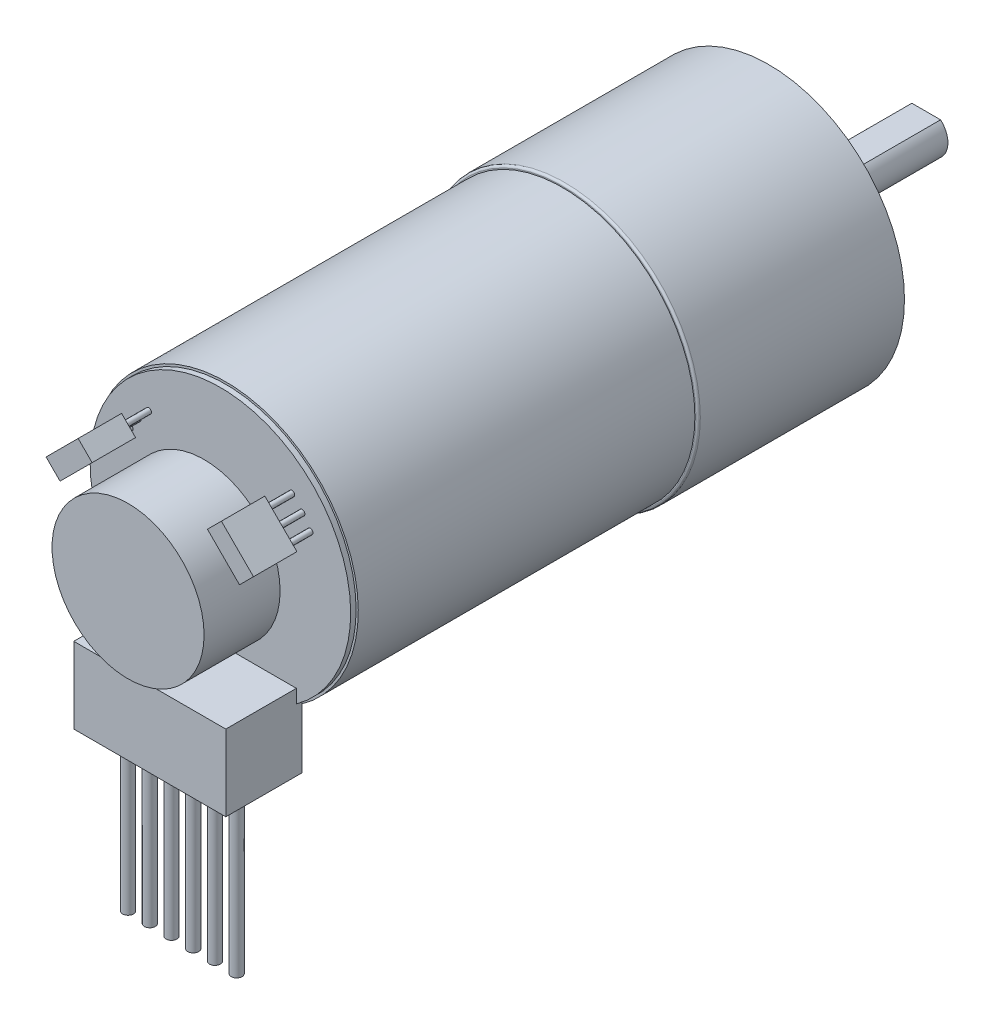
ISO-10303-21;
HEADER;
FILE_DESCRIPTION(('STEP AP214'),'2;1');
FILE_NAME('part.step','',(''),(''),'','','');
FILE_SCHEMA(('AUTOMOTIVE_DESIGN { 1 0 10303 214 1 1 1 1 }'));
ENDSEC;
DATA;
#1=APPLICATION_CONTEXT('core data for automotive mechanical design processes');
#2=APPLICATION_PROTOCOL_DEFINITION('international standard','automotive_design',2000,#1);
#3=PRODUCT_CONTEXT('',#1,'mechanical');
#4=PRODUCT('Part','Part','',(#3));
#5=PRODUCT_RELATED_PRODUCT_CATEGORY('part','',(#4));
#6=PRODUCT_DEFINITION_FORMATION('','',#4);
#7=PRODUCT_DEFINITION_CONTEXT('part definition',#1,'design');
#8=PRODUCT_DEFINITION('design','',#6,#7);
#9=PRODUCT_DEFINITION_SHAPE('','',#8);
#10=(LENGTH_UNIT() NAMED_UNIT(*) SI_UNIT(.MILLI.,.METRE.));
#11=(NAMED_UNIT(*) PLANE_ANGLE_UNIT() SI_UNIT($,.RADIAN.));
#12=(NAMED_UNIT(*) SI_UNIT($,.STERADIAN.) SOLID_ANGLE_UNIT());
#13=UNCERTAINTY_MEASURE_WITH_UNIT(LENGTH_MEASURE(1.E-05),#10,'distance_accuracy_value','');
#14=(GEOMETRIC_REPRESENTATION_CONTEXT(3) GLOBAL_UNCERTAINTY_ASSIGNED_CONTEXT((#13)) GLOBAL_UNIT_ASSIGNED_CONTEXT((#10,
#11,#12)) REPRESENTATION_CONTEXT('',''));
#15=CARTESIAN_POINT('',(0.,0.,0.));
#16=DIRECTION('',(0.,0.,1.));
#17=DIRECTION('',(1.,0.,0.));
#18=AXIS2_PLACEMENT_3D('',#15,#16,#17);
#19=CARTESIAN_POINT('',(7.,-8.5,57.));
#20=DIRECTION('',(-1.,0.,0.));
#21=DIRECTION('',(0.,0.,1.));
#22=AXIS2_PLACEMENT_3D('',#19,#20,#21);
#23=PLANE('',#22);
#24=DIRECTION('',(0.,0.,-1.));
#25=VECTOR('',#24,1.);
#26=CARTESIAN_POINT('',(7.,-9.74679434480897,50.5));
#27=LINE('',#26,#25);
#28=CARTESIAN_POINT('',(7.,-9.74679434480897,50.5));
#29=VERTEX_POINT('',#28);
#30=CARTESIAN_POINT('',(7.,-9.74679434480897,50.));
#31=VERTEX_POINT('',#30);
#32=EDGE_CURVE('E240',#29,#31,#27,.T.);
#33=ORIENTED_EDGE('',*,*,#32,.F.);
#34=DIRECTION('',(0.,1.,0.));
#35=VECTOR('',#34,1.);
#36=CARTESIAN_POINT('',(7.,-8.5,50.5));
#37=LINE('',#36,#35);
#38=CARTESIAN_POINT('',(7.,-8.5,50.5));
#39=VERTEX_POINT('',#38);
#40=EDGE_CURVE('E232',#29,#39,#37,.T.);
#41=ORIENTED_EDGE('',*,*,#40,.T.);
#42=DIRECTION('',(0.,0.,-1.));
#43=VECTOR('',#42,1.);
#44=CARTESIAN_POINT('',(7.,-8.5,57.));
#45=LINE('',#44,#43);
#46=CARTESIAN_POINT('',(7.,-8.5,57.));
#47=VERTEX_POINT('',#46);
#48=EDGE_CURVE('E413',#47,#39,#45,.T.);
#49=ORIENTED_EDGE('',*,*,#48,.F.);
#50=DIRECTION('',(0.,1.,0.));
#51=VECTOR('',#50,1.);
#52=CARTESIAN_POINT('',(7.,-8.5,57.));
#53=LINE('',#52,#51);
#54=CARTESIAN_POINT('',(7.,-15.5,57.));
#55=VERTEX_POINT('',#54);
#56=EDGE_CURVE('E388',#55,#47,#53,.T.);
#57=ORIENTED_EDGE('',*,*,#56,.F.);
#58=DIRECTION('',(0.,0.,-1.));
#59=VECTOR('',#58,1.);
#60=CARTESIAN_POINT('',(7.,-15.5,57.));
#61=LINE('',#60,#59);
#62=CARTESIAN_POINT('',(7.,-15.5,50.));
#63=VERTEX_POINT('',#62);
#64=EDGE_CURVE('E398',#55,#63,#61,.T.);
#65=ORIENTED_EDGE('',*,*,#64,.T.);
#66=DIRECTION('',(0.,1.,0.));
#67=VECTOR('',#66,1.);
#68=CARTESIAN_POINT('',(7.,-8.5,50.));
#69=LINE('',#68,#67);
#70=CARTESIAN_POINT('',(7.,-9.99199679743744,50.));
#71=VERTEX_POINT('',#70);
#72=EDGE_CURVE('E382',#63,#71,#69,.T.);
#73=ORIENTED_EDGE('',*,*,#72,.T.);
#74=DIRECTION('',(0.,-1.,0.));
#75=VECTOR('',#74,1.);
#76=CARTESIAN_POINT('',(7.,0.,50.));
#77=LINE('',#76,#75);
#78=EDGE_CURVE('E459',#31,#71,#77,.T.);
#79=ORIENTED_EDGE('',*,*,#78,.F.);
#80=EDGE_LOOP('',(#33,#41,#49,#57,#65,#73,#79));
#81=FACE_BOUND('',#80,.T.);
#82=ADVANCED_FACE('F38',(#81),#23,.F.);
#83=CARTESIAN_POINT('',(-7.,-8.5,57.));
#84=DIRECTION('',(1.,0.,0.));
#85=DIRECTION('',(0.,1.,0.));
#86=AXIS2_PLACEMENT_3D('',#83,#84,#85);
#87=PLANE('',#86);
#88=DIRECTION('',(0.,0.,-1.));
#89=VECTOR('',#88,1.);
#90=CARTESIAN_POINT('',(-7.,-9.74679434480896,50.5));
#91=LINE('',#90,#89);
#92=CARTESIAN_POINT('',(-7.,-9.74679434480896,50.));
#93=VERTEX_POINT('',#92);
#94=CARTESIAN_POINT('',(-7.,-9.74679434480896,50.5));
#95=VERTEX_POINT('',#94);
#96=EDGE_CURVE('E238',#93,#95,#91,.F.);
#97=ORIENTED_EDGE('',*,*,#96,.F.);
#98=DIRECTION('',(0.,-1.,0.));
#99=VECTOR('',#98,1.);
#100=CARTESIAN_POINT('',(-7.,-8.5,50.));
#101=LINE('',#100,#99);
#102=CARTESIAN_POINT('',(-7.,-9.99199679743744,50.));
#103=VERTEX_POINT('',#102);
#104=EDGE_CURVE('E402',#93,#103,#101,.T.);
#105=ORIENTED_EDGE('',*,*,#104,.T.);
#106=CARTESIAN_POINT('',(-7.,-15.5,50.));
#107=VERTEX_POINT('',#106);
#108=EDGE_CURVE('E401',#103,#107,#101,.T.);
#109=ORIENTED_EDGE('',*,*,#108,.T.);
#110=DIRECTION('',(0.,0.,-1.));
#111=VECTOR('',#110,1.);
#112=CARTESIAN_POINT('',(-7.,-15.5,57.));
#113=LINE('',#112,#111);
#114=CARTESIAN_POINT('',(-7.,-15.5,57.));
#115=VERTEX_POINT('',#114);
#116=EDGE_CURVE('E407',#115,#107,#113,.T.);
#117=ORIENTED_EDGE('',*,*,#116,.F.);
#118=DIRECTION('',(0.,-1.,0.));
#119=VECTOR('',#118,1.);
#120=CARTESIAN_POINT('',(-7.,-8.5,57.));
#121=LINE('',#120,#119);
#122=CARTESIAN_POINT('',(-7.,-8.5,57.));
#123=VERTEX_POINT('',#122);
#124=EDGE_CURVE('E394',#123,#115,#121,.T.);
#125=ORIENTED_EDGE('',*,*,#124,.F.);
#126=DIRECTION('',(0.,0.,-1.));
#127=VECTOR('',#126,1.);
#128=CARTESIAN_POINT('',(-7.,-8.5,57.));
#129=LINE('',#128,#127);
#130=CARTESIAN_POINT('',(-7.,-8.5,50.5));
#131=VERTEX_POINT('',#130);
#132=EDGE_CURVE('E410',#123,#131,#129,.T.);
#133=ORIENTED_EDGE('',*,*,#132,.T.);
#134=DIRECTION('',(0.,-1.,0.));
#135=VECTOR('',#134,1.);
#136=CARTESIAN_POINT('',(-7.,-8.5,50.5));
#137=LINE('',#136,#135);
#138=EDGE_CURVE('E226',#131,#95,#137,.T.);
#139=ORIENTED_EDGE('',*,*,#138,.T.);
#140=EDGE_LOOP('',(#97,#105,#109,#117,#125,#133,#139));
#141=FACE_BOUND('',#140,.T.);
#142=ADVANCED_FACE('F483',(#141),#87,.F.);
#143=CARTESIAN_POINT('',(0.,0.,50.));
#144=DIRECTION('',(0.,0.,1.));
#145=DIRECTION('',(1.,0.,0.));
#146=AXIS2_PLACEMENT_3D('',#143,#144,#145);
#147=PLANE('',#146);
#148=ORIENTED_EDGE('',*,*,#104,.F.);
#149=CARTESIAN_POINT('',(0.,0.,50.));
#150=DIRECTION('',(0.,0.,1.));
#151=DIRECTION('',(1.,0.,0.));
#152=AXIS2_PLACEMENT_3D('',#149,#150,#151);
#153=CIRCLE('',#152,12.);
#154=EDGE_CURVE('E207',#31,#93,#153,.T.);
#155=ORIENTED_EDGE('',*,*,#154,.F.);
#156=ORIENTED_EDGE('',*,*,#78,.T.);
#157=CARTESIAN_POINT('',(0.,0.,50.));
#158=DIRECTION('',(0.,0.,1.));
#159=DIRECTION('',(1.,0.,0.));
#160=AXIS2_PLACEMENT_3D('',#157,#158,#159);
#161=CIRCLE('',#160,12.2);
#162=EDGE_CURVE('E451',#71,#103,#161,.T.);
#163=ORIENTED_EDGE('',*,*,#162,.T.);
#164=EDGE_LOOP('',(#148,#155,#156,#163));
#165=FACE_BOUND('',#164,.T.);
#166=ADVANCED_FACE('F489',(#165),#147,.T.);
#167=CARTESIAN_POINT('',(0.,0.,19.));
#168=DIRECTION('',(0.,0.,-1.));
#169=DIRECTION('',(-1.,0.,0.));
#170=AXIS2_PLACEMENT_3D('',#167,#168,#169);
#171=CYLINDRICAL_SURFACE('',#170,12.5);
#172=CARTESIAN_POINT('',(0.,0.,18.8));
#173=DIRECTION('',(0.,0.,1.));
#174=DIRECTION('',(1.,0.,0.));
#175=AXIS2_PLACEMENT_3D('',#172,#173,#174);
#176=CIRCLE('',#175,12.5);
#177=CARTESIAN_POINT('',(12.5,0.,18.8));
#178=VERTEX_POINT('',#177);
#179=EDGE_CURVE('E11',#178,#178,#176,.F.);
#180=ORIENTED_EDGE('',*,*,#179,.T.);
#181=EDGE_LOOP('',(#180));
#182=FACE_BOUND('',#181,.T.);
#183=CARTESIAN_POINT('',(0.,0.,0.));
#184=DIRECTION('',(0.,0.,1.));
#185=DIRECTION('',(1.,0.,0.));
#186=AXIS2_PLACEMENT_3D('',#183,#184,#185);
#187=CIRCLE('',#186,12.5);
#188=CARTESIAN_POINT('',(12.5,0.,0.));
#189=VERTEX_POINT('',#188);
#190=EDGE_CURVE('E450',#189,#189,#187,.T.);
#191=ORIENTED_EDGE('',*,*,#190,.T.);
#192=EDGE_LOOP('',(#191));
#193=FACE_BOUND('',#192,.T.);
#194=ADVANCED_FACE('F535',(#182,#193),#171,.T.);
#195=CARTESIAN_POINT('',(0.,0.,19.));
#196=DIRECTION('',(0.,0.,1.));
#197=DIRECTION('',(1.,0.,0.));
#198=AXIS2_PLACEMENT_3D('',#195,#196,#197);
#199=PLANE('',#198);
#200=CARTESIAN_POINT('',(0.,0.,19.));
#201=DIRECTION('',(0.,0.,1.));
#202=DIRECTION('',(1.,0.,0.));
#203=AXIS2_PLACEMENT_3D('',#200,#201,#202);
#204=CIRCLE('',#203,12.3);
#205=CARTESIAN_POINT('',(12.3,0.,19.));
#206=VERTEX_POINT('',#205);
#207=EDGE_CURVE('E46',#206,#206,#204,.T.);
#208=ORIENTED_EDGE('',*,*,#207,.T.);
#209=EDGE_LOOP('',(#208));
#210=FACE_BOUND('',#209,.T.);
#211=CARTESIAN_POINT('',(0.,0.,19.));
#212=DIRECTION('',(0.,0.,1.));
#213=DIRECTION('',(1.,0.,0.));
#214=AXIS2_PLACEMENT_3D('',#211,#212,#213);
#215=CIRCLE('',#214,12.2);
#216=CARTESIAN_POINT('',(12.2,0.,19.));
#217=VERTEX_POINT('',#216);
#218=EDGE_CURVE('E446',#217,#217,#215,.T.);
#219=ORIENTED_EDGE('',*,*,#218,.F.);
#220=EDGE_LOOP('',(#219));
#221=FACE_BOUND('',#220,.T.);
#222=ADVANCED_FACE('F465',(#210,#221),#199,.T.);
#223=CARTESIAN_POINT('',(0.,0.,0.));
#224=DIRECTION('',(0.,0.,1.));
#225=DIRECTION('',(1.,0.,0.));
#226=AXIS2_PLACEMENT_3D('',#223,#224,#225);
#227=PLANE('',#226);
#228=CARTESIAN_POINT('',(0.,8.5,0.));
#229=DIRECTION('',(0.,0.,-1.));
#230=DIRECTION('',(-1.,0.,0.));
#231=AXIS2_PLACEMENT_3D('',#228,#229,#230);
#232=CIRCLE('',#231,1.25);
#233=CARTESIAN_POINT('',(-1.25,8.5,0.));
#234=VERTEX_POINT('',#233);
#235=EDGE_CURVE('E197',#234,#234,#232,.T.);
#236=ORIENTED_EDGE('',*,*,#235,.F.);
#237=EDGE_LOOP('',(#236));
#238=FACE_BOUND('',#237,.T.);
#239=CARTESIAN_POINT('',(0.,-8.5,0.));
#240=DIRECTION('',(0.,0.,-1.));
#241=DIRECTION('',(-1.,0.,0.));
#242=AXIS2_PLACEMENT_3D('',#239,#240,#241);
#243=CIRCLE('',#242,1.25);
#244=CARTESIAN_POINT('',(-1.25,-8.5,0.));
#245=VERTEX_POINT('',#244);
#246=EDGE_CURVE('E196',#245,#245,#243,.T.);
#247=ORIENTED_EDGE('',*,*,#246,.F.);
#248=EDGE_LOOP('',(#247));
#249=FACE_BOUND('',#248,.T.);
#250=CARTESIAN_POINT('',(0.,0.,0.));
#251=DIRECTION('',(0.,0.,1.));
#252=DIRECTION('',(1.,0.,0.));
#253=AXIS2_PLACEMENT_3D('',#250,#251,#252);
#254=CIRCLE('',#253,3.5);
#255=CARTESIAN_POINT('',(3.5,0.,0.));
#256=VERTEX_POINT('',#255);
#257=EDGE_CURVE('E456',#256,#256,#254,.F.);
#258=ORIENTED_EDGE('',*,*,#257,.F.);
#259=EDGE_LOOP('',(#258));
#260=FACE_BOUND('',#259,.T.);
#261=ORIENTED_EDGE('',*,*,#190,.F.);
#262=EDGE_LOOP('',(#261));
#263=FACE_BOUND('',#262,.T.);
#264=ADVANCED_FACE('F539',(#238,#249,#260,#263),#227,.F.);
#265=CARTESIAN_POINT('',(0.,0.,50.));
#266=DIRECTION('',(0.,0.,-1.));
#267=DIRECTION('',(-1.,0.,0.));
#268=AXIS2_PLACEMENT_3D('',#265,#266,#267);
#269=CYLINDRICAL_SURFACE('',#268,12.2);
#270=EDGE_CURVE('E447',#103,#71,#161,.T.);
#271=ORIENTED_EDGE('',*,*,#270,.F.);
#272=ORIENTED_EDGE('',*,*,#162,.F.);
#273=EDGE_LOOP('',(#271,#272));
#274=FACE_BOUND('',#273,.T.);
#275=ORIENTED_EDGE('',*,*,#218,.T.);
#276=EDGE_LOOP('',(#275));
#277=FACE_BOUND('',#276,.T.);
#278=ADVANCED_FACE('F531',(#274,#277),#269,.T.);
#279=CARTESIAN_POINT('',(0.,0.,-2.5));
#280=DIRECTION('',(0.,0.,1.));
#281=DIRECTION('',(1.,0.,0.));
#282=AXIS2_PLACEMENT_3D('',#279,#280,#281);
#283=CYLINDRICAL_SURFACE('',#282,3.5);
#284=CARTESIAN_POINT('',(0.,0.,-2.5));
#285=DIRECTION('',(0.,0.,-1.));
#286=DIRECTION('',(-1.,0.,0.));
#287=AXIS2_PLACEMENT_3D('',#284,#285,#286);
#288=CIRCLE('',#287,3.5);
#289=CARTESIAN_POINT('',(-3.5,0.,-2.5));
#290=VERTEX_POINT('',#289);
#291=EDGE_CURVE('E441',#290,#290,#288,.T.);
#292=ORIENTED_EDGE('',*,*,#291,.F.);
#293=EDGE_LOOP('',(#292));
#294=FACE_BOUND('',#293,.T.);
#295=ORIENTED_EDGE('',*,*,#257,.T.);
#296=EDGE_LOOP('',(#295));
#297=FACE_BOUND('',#296,.T.);
#298=ADVANCED_FACE('F527',(#294,#297),#283,.T.);
#299=CARTESIAN_POINT('',(0.,0.,-2.5));
#300=DIRECTION('',(0.,0.,-1.));
#301=DIRECTION('',(-1.,0.,0.));
#302=AXIS2_PLACEMENT_3D('',#299,#300,#301);
#303=PLANE('',#302);
#304=CARTESIAN_POINT('',(0.,0.,-2.5));
#305=DIRECTION('',(0.,0.,-1.));
#306=DIRECTION('',(-1.,0.,0.));
#307=AXIS2_PLACEMENT_3D('',#304,#305,#306);
#308=CIRCLE('',#307,2.);
#309=CARTESIAN_POINT('',(-2.,0.,-2.5));
#310=VERTEX_POINT('',#309);
#311=EDGE_CURVE('E436',#310,#310,#308,.T.);
#312=ORIENTED_EDGE('',*,*,#311,.F.);
#313=EDGE_LOOP('',(#312));
#314=FACE_BOUND('',#313,.T.);
#315=ORIENTED_EDGE('',*,*,#291,.T.);
#316=EDGE_LOOP('',(#315));
#317=FACE_BOUND('',#316,.T.);
#318=ADVANCED_FACE('F523',(#314,#317),#303,.T.);
#319=CARTESIAN_POINT('',(0.,0.,-14.5));
#320=DIRECTION('',(0.,0.,1.));
#321=DIRECTION('',(1.,0.,0.));
#322=AXIS2_PLACEMENT_3D('',#319,#320,#321);
#323=CYLINDRICAL_SURFACE('',#322,2.);
#324=CARTESIAN_POINT('',(0.,0.,-14.5));
#325=DIRECTION('',(0.,0.,-1.));
#326=DIRECTION('',(-1.,0.,0.));
#327=AXIS2_PLACEMENT_3D('',#324,#325,#326);
#328=CIRCLE('',#327,2.);
#329=CARTESIAN_POINT('',(1.3228756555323,1.5,-14.5));
#330=VERTEX_POINT('',#329);
#331=CARTESIAN_POINT('',(-1.3228756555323,1.5,-14.5));
#332=VERTEX_POINT('',#331);
#333=EDGE_CURVE('E438',#330,#332,#328,.T.);
#334=ORIENTED_EDGE('',*,*,#333,.F.);
#335=DIRECTION('',(0.,0.,-1.));
#336=VECTOR('',#335,1.);
#337=CARTESIAN_POINT('',(1.3228756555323,1.5,-6.5));
#338=LINE('',#337,#336);
#339=CARTESIAN_POINT('',(1.3228756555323,1.5,-6.5));
#340=VERTEX_POINT('',#339);
#341=EDGE_CURVE('E431',#340,#330,#338,.T.);
#342=ORIENTED_EDGE('',*,*,#341,.F.);
#343=CARTESIAN_POINT('',(0.,0.,-6.5));
#344=DIRECTION('',(0.,0.,-1.));
#345=DIRECTION('',(-1.,0.,0.));
#346=AXIS2_PLACEMENT_3D('',#343,#344,#345);
#347=CIRCLE('',#346,2.);
#348=CARTESIAN_POINT('',(-1.3228756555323,1.5,-6.5));
#349=VERTEX_POINT('',#348);
#350=EDGE_CURVE('E426',#349,#340,#347,.T.);
#351=ORIENTED_EDGE('',*,*,#350,.F.);
#352=DIRECTION('',(0.,0.,-1.));
#353=VECTOR('',#352,1.);
#354=CARTESIAN_POINT('',(-1.3228756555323,1.5,-6.5));
#355=LINE('',#354,#353);
#356=EDGE_CURVE('E433',#349,#332,#355,.T.);
#357=ORIENTED_EDGE('',*,*,#356,.T.);
#358=EDGE_LOOP('',(#334,#342,#351,#357));
#359=FACE_BOUND('',#358,.T.);
#360=ORIENTED_EDGE('',*,*,#311,.T.);
#361=EDGE_LOOP('',(#360));
#362=FACE_BOUND('',#361,.T.);
#363=ADVANCED_FACE('F519',(#359,#362),#323,.T.);
#364=CARTESIAN_POINT('',(0.,0.,-14.5));
#365=DIRECTION('',(0.,0.,-1.));
#366=DIRECTION('',(-1.,0.,0.));
#367=AXIS2_PLACEMENT_3D('',#364,#365,#366);
#368=PLANE('',#367);
#369=DIRECTION('',(-1.,0.,0.));
#370=VECTOR('',#369,1.);
#371=CARTESIAN_POINT('',(1.3228756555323,1.5,-14.5));
#372=LINE('',#371,#370);
#373=EDGE_CURVE('E425',#330,#332,#372,.T.);
#374=ORIENTED_EDGE('',*,*,#373,.F.);
#375=ORIENTED_EDGE('',*,*,#333,.T.);
#376=EDGE_LOOP('',(#374,#375));
#377=FACE_BOUND('',#376,.T.);
#378=ADVANCED_FACE('F515',(#377),#368,.T.);
#379=CARTESIAN_POINT('',(1.3228756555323,1.5,-6.5));
#380=DIRECTION('',(0.,-1.,0.));
#381=DIRECTION('',(0.,0.,-1.));
#382=AXIS2_PLACEMENT_3D('',#379,#380,#381);
#383=PLANE('',#382);
#384=ORIENTED_EDGE('',*,*,#373,.T.);
#385=ORIENTED_EDGE('',*,*,#356,.F.);
#386=DIRECTION('',(-1.,0.,0.));
#387=VECTOR('',#386,1.);
#388=CARTESIAN_POINT('',(1.3228756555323,1.5,-6.5));
#389=LINE('',#388,#387);
#390=EDGE_CURVE('E428',#340,#349,#389,.T.);
#391=ORIENTED_EDGE('',*,*,#390,.F.);
#392=ORIENTED_EDGE('',*,*,#341,.T.);
#393=EDGE_LOOP('',(#384,#385,#391,#392));
#394=FACE_BOUND('',#393,.T.);
#395=ADVANCED_FACE('F511',(#394),#383,.F.);
#396=CARTESIAN_POINT('',(0.,0.,-6.5));
#397=DIRECTION('',(0.,0.,-1.));
#398=DIRECTION('',(-1.,0.,0.));
#399=AXIS2_PLACEMENT_3D('',#396,#397,#398);
#400=PLANE('',#399);
#401=ORIENTED_EDGE('',*,*,#350,.T.);
#402=ORIENTED_EDGE('',*,*,#390,.T.);
#403=EDGE_LOOP('',(#401,#402));
#404=FACE_BOUND('',#403,.T.);
#405=ADVANCED_FACE('F508',(#404),#400,.T.);
#406=CARTESIAN_POINT('',(-7.,-8.5,57.));
#407=DIRECTION('',(0.,-1.,0.));
#408=DIRECTION('',(0.,0.,-1.));
#409=AXIS2_PLACEMENT_3D('',#406,#407,#408);
#410=PLANE('',#409);
#411=ORIENTED_EDGE('',*,*,#48,.T.);
#412=DIRECTION('',(-1.,0.,0.));
#413=VECTOR('',#412,1.);
#414=CARTESIAN_POINT('',(-7.,-8.5,50.5));
#415=LINE('',#414,#413);
#416=EDGE_CURVE('E229',#39,#131,#415,.T.);
#417=ORIENTED_EDGE('',*,*,#416,.T.);
#418=ORIENTED_EDGE('',*,*,#132,.F.);
#419=DIRECTION('',(-1.,0.,0.));
#420=VECTOR('',#419,1.);
#421=CARTESIAN_POINT('',(-7.,-8.5,57.));
#422=LINE('',#421,#420);
#423=EDGE_CURVE('E391',#47,#123,#422,.T.);
#424=ORIENTED_EDGE('',*,*,#423,.F.);
#425=EDGE_LOOP('',(#411,#417,#418,#424));
#426=FACE_BOUND('',#425,.T.);
#427=ADVANCED_FACE('F495',(#426),#410,.F.);
#428=CARTESIAN_POINT('',(-7.,-15.5,57.));
#429=DIRECTION('',(0.,1.,0.));
#430=DIRECTION('',(0.,0.,1.));
#431=AXIS2_PLACEMENT_3D('',#428,#429,#430);
#432=PLANE('',#431);
#433=DIRECTION('',(1.,0.,0.));
#434=VECTOR('',#433,1.);
#435=CARTESIAN_POINT('',(-6.5,-15.5,50.5));
#436=LINE('',#435,#434);
#437=CARTESIAN_POINT('',(-6.5,-15.5,50.5));
#438=VERTEX_POINT('',#437);
#439=CARTESIAN_POINT('',(6.5,-15.5,50.5));
#440=VERTEX_POINT('',#439);
#441=EDGE_CURVE('E373',#438,#440,#436,.T.);
#442=ORIENTED_EDGE('',*,*,#441,.F.);
#443=DIRECTION('',(0.,0.,-1.));
#444=VECTOR('',#443,1.);
#445=CARTESIAN_POINT('',(-6.5,-15.5,56.5));
#446=LINE('',#445,#444);
#447=CARTESIAN_POINT('',(-6.5,-15.5,56.5));
#448=VERTEX_POINT('',#447);
#449=EDGE_CURVE('E358',#448,#438,#446,.T.);
#450=ORIENTED_EDGE('',*,*,#449,.F.);
#451=DIRECTION('',(-1.,0.,0.));
#452=VECTOR('',#451,1.);
#453=CARTESIAN_POINT('',(-6.5,-15.5,56.5));
#454=LINE('',#453,#452);
#455=CARTESIAN_POINT('',(6.5,-15.5,56.5));
#456=VERTEX_POINT('',#455);
#457=EDGE_CURVE('E363',#456,#448,#454,.T.);
#458=ORIENTED_EDGE('',*,*,#457,.F.);
#459=DIRECTION('',(0.,0.,1.));
#460=VECTOR('',#459,1.);
#461=CARTESIAN_POINT('',(6.5,-15.5,56.5));
#462=LINE('',#461,#460);
#463=EDGE_CURVE('E375',#440,#456,#462,.T.);
#464=ORIENTED_EDGE('',*,*,#463,.F.);
#465=EDGE_LOOP('',(#442,#450,#458,#464));
#466=FACE_BOUND('',#465,.T.);
#467=DIRECTION('',(1.,0.,0.));
#468=VECTOR('',#467,1.);
#469=CARTESIAN_POINT('',(-7.,-15.5,50.));
#470=LINE('',#469,#468);
#471=EDGE_CURVE('E392',#107,#63,#470,.T.);
#472=ORIENTED_EDGE('',*,*,#471,.T.);
#473=ORIENTED_EDGE('',*,*,#64,.F.);
#474=DIRECTION('',(1.,0.,0.));
#475=VECTOR('',#474,1.);
#476=CARTESIAN_POINT('',(-7.,-15.5,57.));
#477=LINE('',#476,#475);
#478=EDGE_CURVE('E396',#115,#55,#477,.T.);
#479=ORIENTED_EDGE('',*,*,#478,.F.);
#480=ORIENTED_EDGE('',*,*,#116,.T.);
#481=EDGE_LOOP('',(#472,#473,#479,#480));
#482=FACE_BOUND('',#481,.T.);
#483=ADVANCED_FACE('F601',(#466,#482),#432,.F.);
#484=CARTESIAN_POINT('',(0.,0.,57.));
#485=DIRECTION('',(0.,0.,1.));
#486=DIRECTION('',(1.,0.,0.));
#487=AXIS2_PLACEMENT_3D('',#484,#485,#486);
#488=PLANE('',#487);
#489=ORIENTED_EDGE('',*,*,#56,.T.);
#490=ORIENTED_EDGE('',*,*,#423,.T.);
#491=ORIENTED_EDGE('',*,*,#124,.T.);
#492=ORIENTED_EDGE('',*,*,#478,.T.);
#493=EDGE_LOOP('',(#489,#490,#491,#492));
#494=FACE_BOUND('',#493,.T.);
#495=ADVANCED_FACE('F609',(#494),#488,.T.);
#496=CARTESIAN_POINT('',(0.,0.,50.));
#497=DIRECTION('',(0.,0.,1.));
#498=DIRECTION('',(1.,0.,0.));
#499=AXIS2_PLACEMENT_3D('',#496,#497,#498);
#500=PLANE('',#499);
#501=ORIENTED_EDGE('',*,*,#108,.F.);
#502=ORIENTED_EDGE('',*,*,#270,.T.);
#503=ORIENTED_EDGE('',*,*,#72,.F.);
#504=ORIENTED_EDGE('',*,*,#471,.F.);
#505=EDGE_LOOP('',(#501,#502,#503,#504));
#506=FACE_BOUND('',#505,.T.);
#507=ADVANCED_FACE('F618',(#506),#500,.F.);
#508=CARTESIAN_POINT('',(-6.5,-9.5,56.5));
#509=DIRECTION('',(-1.,0.,0.));
#510=DIRECTION('',(0.,0.,1.));
#511=AXIS2_PLACEMENT_3D('',#508,#509,#510);
#512=PLANE('',#511);
#513=ORIENTED_EDGE('',*,*,#449,.T.);
#514=DIRECTION('',(0.,-1.,0.));
#515=VECTOR('',#514,1.);
#516=CARTESIAN_POINT('',(-6.5,-9.5,50.5));
#517=LINE('',#516,#515);
#518=CARTESIAN_POINT('',(-6.5,-9.5,50.5));
#519=VERTEX_POINT('',#518);
#520=EDGE_CURVE('E61',#519,#438,#517,.T.);
#521=ORIENTED_EDGE('',*,*,#520,.F.);
#522=DIRECTION('',(0.,0.,-1.));
#523=VECTOR('',#522,1.);
#524=CARTESIAN_POINT('',(-6.5,-9.5,56.5));
#525=LINE('',#524,#523);
#526=CARTESIAN_POINT('',(-6.5,-9.5,56.5));
#527=VERTEX_POINT('',#526);
#528=EDGE_CURVE('E359',#527,#519,#525,.T.);
#529=ORIENTED_EDGE('',*,*,#528,.F.);
#530=DIRECTION('',(0.,-1.,0.));
#531=VECTOR('',#530,1.);
#532=CARTESIAN_POINT('',(-6.5,-9.5,56.5));
#533=LINE('',#532,#531);
#534=EDGE_CURVE('E380',#527,#448,#533,.T.);
#535=ORIENTED_EDGE('',*,*,#534,.T.);
#536=EDGE_LOOP('',(#513,#521,#529,#535));
#537=FACE_BOUND('',#536,.T.);
#538=ADVANCED_FACE('F625',(#537),#512,.F.);
#539=CARTESIAN_POINT('',(-6.5,-9.5,56.5));
#540=DIRECTION('',(0.,0.,1.));
#541=DIRECTION('',(1.,0.,0.));
#542=AXIS2_PLACEMENT_3D('',#539,#540,#541);
#543=PLANE('',#542);
#544=ORIENTED_EDGE('',*,*,#457,.T.);
#545=ORIENTED_EDGE('',*,*,#534,.F.);
#546=DIRECTION('',(-1.,0.,0.));
#547=VECTOR('',#546,1.);
#548=CARTESIAN_POINT('',(-6.5,-9.5,56.5));
#549=LINE('',#548,#547);
#550=CARTESIAN_POINT('',(6.5,-9.5,56.5));
#551=VERTEX_POINT('',#550);
#552=EDGE_CURVE('E369',#551,#527,#549,.T.);
#553=ORIENTED_EDGE('',*,*,#552,.F.);
#554=DIRECTION('',(0.,-1.,0.));
#555=VECTOR('',#554,1.);
#556=CARTESIAN_POINT('',(6.5,-9.5,56.5));
#557=LINE('',#556,#555);
#558=EDGE_CURVE('E383',#551,#456,#557,.T.);
#559=ORIENTED_EDGE('',*,*,#558,.T.);
#560=EDGE_LOOP('',(#544,#545,#553,#559));
#561=FACE_BOUND('',#560,.T.);
#562=ADVANCED_FACE('F632',(#561),#543,.F.);
#563=CARTESIAN_POINT('',(6.5,-9.5,56.5));
#564=DIRECTION('',(1.,0.,0.));
#565=DIRECTION('',(0.,0.,-1.));
#566=AXIS2_PLACEMENT_3D('',#563,#564,#565);
#567=PLANE('',#566);
#568=ORIENTED_EDGE('',*,*,#463,.T.);
#569=ORIENTED_EDGE('',*,*,#558,.F.);
#570=DIRECTION('',(0.,0.,1.));
#571=VECTOR('',#570,1.);
#572=CARTESIAN_POINT('',(6.5,-9.5,56.5));
#573=LINE('',#572,#571);
#574=CARTESIAN_POINT('',(6.5,-9.5,50.5));
#575=VERTEX_POINT('',#574);
#576=EDGE_CURVE('E366',#575,#551,#573,.T.);
#577=ORIENTED_EDGE('',*,*,#576,.F.);
#578=DIRECTION('',(0.,-1.,0.));
#579=VECTOR('',#578,1.);
#580=CARTESIAN_POINT('',(6.5,-9.5,50.5));
#581=LINE('',#580,#579);
#582=EDGE_CURVE('E385',#575,#440,#581,.T.);
#583=ORIENTED_EDGE('',*,*,#582,.T.);
#584=EDGE_LOOP('',(#568,#569,#577,#583));
#585=FACE_BOUND('',#584,.T.);
#586=ADVANCED_FACE('F640',(#585),#567,.F.);
#587=CARTESIAN_POINT('',(-6.5,-9.5,50.5));
#588=DIRECTION('',(0.,0.,-1.));
#589=DIRECTION('',(-1.,0.,0.));
#590=AXIS2_PLACEMENT_3D('',#587,#588,#589);
#591=PLANE('',#590);
#592=ORIENTED_EDGE('',*,*,#441,.T.);
#593=ORIENTED_EDGE('',*,*,#582,.F.);
#594=DIRECTION('',(1.,0.,0.));
#595=VECTOR('',#594,1.);
#596=CARTESIAN_POINT('',(-6.5,-9.5,50.5));
#597=LINE('',#596,#595);
#598=EDGE_CURVE('E362',#519,#575,#597,.T.);
#599=ORIENTED_EDGE('',*,*,#598,.F.);
#600=ORIENTED_EDGE('',*,*,#520,.T.);
#601=EDGE_LOOP('',(#592,#593,#599,#600));
#602=FACE_BOUND('',#601,.T.);
#603=ADVANCED_FACE('F648',(#602),#591,.F.);
#604=CARTESIAN_POINT('',(0.,-9.5,0.));
#605=DIRECTION('',(0.,-1.,0.));
#606=DIRECTION('',(0.,0.,-1.));
#607=AXIS2_PLACEMENT_3D('',#604,#605,#606);
#608=PLANE('',#607);
#609=CARTESIAN_POINT('',(5.,-9.5,54.));
#610=DIRECTION('',(0.,-1.,0.));
#611=DIRECTION('',(0.,0.,-1.));
#612=AXIS2_PLACEMENT_3D('',#609,#610,#611);
#613=CIRCLE('',#612,0.500000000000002);
#614=CARTESIAN_POINT('',(5.,-9.5,53.5));
#615=VERTEX_POINT('',#614);
#616=EDGE_CURVE('E340',#615,#615,#613,.T.);
#617=ORIENTED_EDGE('',*,*,#616,.F.);
#618=EDGE_LOOP('',(#617));
#619=FACE_BOUND('',#618,.T.);
#620=CARTESIAN_POINT('',(3.,-9.5,54.));
#621=DIRECTION('',(0.,-1.,0.));
#622=DIRECTION('',(0.,0.,-1.));
#623=AXIS2_PLACEMENT_3D('',#620,#621,#622);
#624=CIRCLE('',#623,0.500000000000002);
#625=CARTESIAN_POINT('',(3.,-9.5,53.5));
#626=VERTEX_POINT('',#625);
#627=EDGE_CURVE('E343',#626,#626,#624,.T.);
#628=ORIENTED_EDGE('',*,*,#627,.F.);
#629=EDGE_LOOP('',(#628));
#630=FACE_BOUND('',#629,.T.);
#631=CARTESIAN_POINT('',(0.999999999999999,-9.5,54.));
#632=DIRECTION('',(0.,-1.,0.));
#633=DIRECTION('',(0.,0.,-1.));
#634=AXIS2_PLACEMENT_3D('',#631,#632,#633);
#635=CIRCLE('',#634,0.5);
#636=CARTESIAN_POINT('',(0.999999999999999,-9.5,53.5));
#637=VERTEX_POINT('',#636);
#638=EDGE_CURVE('E346',#637,#637,#635,.T.);
#639=ORIENTED_EDGE('',*,*,#638,.F.);
#640=EDGE_LOOP('',(#639));
#641=FACE_BOUND('',#640,.T.);
#642=CARTESIAN_POINT('',(-1.,-9.5,54.));
#643=DIRECTION('',(0.,-1.,0.));
#644=DIRECTION('',(0.,0.,-1.));
#645=AXIS2_PLACEMENT_3D('',#642,#643,#644);
#646=CIRCLE('',#645,0.500000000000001);
#647=CARTESIAN_POINT('',(-1.,-9.5,53.5));
#648=VERTEX_POINT('',#647);
#649=EDGE_CURVE('E349',#648,#648,#646,.T.);
#650=ORIENTED_EDGE('',*,*,#649,.F.);
#651=EDGE_LOOP('',(#650));
#652=FACE_BOUND('',#651,.T.);
#653=CARTESIAN_POINT('',(-3.,-9.5,54.));
#654=DIRECTION('',(0.,-1.,0.));
#655=DIRECTION('',(0.,0.,-1.));
#656=AXIS2_PLACEMENT_3D('',#653,#654,#655);
#657=CIRCLE('',#656,0.5);
#658=CARTESIAN_POINT('',(-3.,-9.5,53.5));
#659=VERTEX_POINT('',#658);
#660=EDGE_CURVE('E352',#659,#659,#657,.T.);
#661=ORIENTED_EDGE('',*,*,#660,.F.);
#662=EDGE_LOOP('',(#661));
#663=FACE_BOUND('',#662,.T.);
#664=CARTESIAN_POINT('',(-5.,-9.5,54.));
#665=DIRECTION('',(0.,-1.,0.));
#666=DIRECTION('',(0.,0.,-1.));
#667=AXIS2_PLACEMENT_3D('',#664,#665,#666);
#668=CIRCLE('',#667,0.500000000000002);
#669=CARTESIAN_POINT('',(-5.,-9.5,53.5));
#670=VERTEX_POINT('',#669);
#671=EDGE_CURVE('E355',#670,#670,#668,.T.);
#672=ORIENTED_EDGE('',*,*,#671,.F.);
#673=EDGE_LOOP('',(#672));
#674=FACE_BOUND('',#673,.T.);
#675=ORIENTED_EDGE('',*,*,#528,.T.);
#676=ORIENTED_EDGE('',*,*,#598,.T.);
#677=ORIENTED_EDGE('',*,*,#576,.T.);
#678=ORIENTED_EDGE('',*,*,#552,.T.);
#679=EDGE_LOOP('',(#675,#676,#677,#678));
#680=FACE_BOUND('',#679,.T.);
#681=ADVANCED_FACE('F656',(#619,#630,#641,#652,#663,#674,#680),#608,.T.);
#682=CARTESIAN_POINT('',(-5.,-9.5,54.));
#683=DIRECTION('',(0.,-1.,0.));
#684=DIRECTION('',(0.,0.,-1.));
#685=AXIS2_PLACEMENT_3D('',#682,#683,#684);
#686=CYLINDRICAL_SURFACE('',#685,0.500000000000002);
#687=ORIENTED_EDGE('',*,*,#671,.T.);
#688=EDGE_LOOP('',(#687));
#689=FACE_BOUND('',#688,.T.);
#690=CARTESIAN_POINT('',(-5.,-30.5,54.));
#691=DIRECTION('',(0.,-1.,0.));
#692=DIRECTION('',(0.,0.,-1.));
#693=AXIS2_PLACEMENT_3D('',#690,#691,#692);
#694=CIRCLE('',#693,0.500000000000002);
#695=CARTESIAN_POINT('',(-5.,-30.5,53.5));
#696=VERTEX_POINT('',#695);
#697=EDGE_CURVE('E257',#696,#696,#694,.T.);
#698=ORIENTED_EDGE('',*,*,#697,.F.);
#699=EDGE_LOOP('',(#698));
#700=FACE_BOUND('',#699,.T.);
#701=ADVANCED_FACE('F663',(#689,#700),#686,.T.);
#702=CARTESIAN_POINT('',(-3.,-9.5,54.));
#703=DIRECTION('',(0.,-1.,0.));
#704=DIRECTION('',(0.,0.,-1.));
#705=AXIS2_PLACEMENT_3D('',#702,#703,#704);
#706=CYLINDRICAL_SURFACE('',#705,0.5);
#707=ORIENTED_EDGE('',*,*,#660,.T.);
#708=EDGE_LOOP('',(#707));
#709=FACE_BOUND('',#708,.T.);
#710=CARTESIAN_POINT('',(-3.,-30.5,54.));
#711=DIRECTION('',(0.,-1.,0.));
#712=DIRECTION('',(0.,0.,-1.));
#713=AXIS2_PLACEMENT_3D('',#710,#711,#712);
#714=CIRCLE('',#713,0.499999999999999);
#715=CARTESIAN_POINT('',(-3.,-30.5,53.5));
#716=VERTEX_POINT('',#715);
#717=EDGE_CURVE('E254',#716,#716,#714,.T.);
#718=ORIENTED_EDGE('',*,*,#717,.F.);
#719=EDGE_LOOP('',(#718));
#720=FACE_BOUND('',#719,.T.);
#721=ADVANCED_FACE('F672',(#709,#720),#706,.T.);
#722=CARTESIAN_POINT('',(-1.,-9.5,54.));
#723=DIRECTION('',(0.,-1.,0.));
#724=DIRECTION('',(0.,0.,-1.));
#725=AXIS2_PLACEMENT_3D('',#722,#723,#724);
#726=CYLINDRICAL_SURFACE('',#725,0.500000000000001);
#727=ORIENTED_EDGE('',*,*,#649,.T.);
#728=EDGE_LOOP('',(#727));
#729=FACE_BOUND('',#728,.T.);
#730=CARTESIAN_POINT('',(-1.,-30.5,54.));
#731=DIRECTION('',(0.,-1.,0.));
#732=DIRECTION('',(0.,0.,-1.));
#733=AXIS2_PLACEMENT_3D('',#730,#731,#732);
#734=CIRCLE('',#733,0.500000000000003);
#735=CARTESIAN_POINT('',(-1.,-30.5,53.5));
#736=VERTEX_POINT('',#735);
#737=EDGE_CURVE('E251',#736,#736,#734,.T.);
#738=ORIENTED_EDGE('',*,*,#737,.F.);
#739=EDGE_LOOP('',(#738));
#740=FACE_BOUND('',#739,.T.);
#741=ADVANCED_FACE('F681',(#729,#740),#726,.T.);
#742=CARTESIAN_POINT('',(0.999999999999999,-9.5,54.));
#743=DIRECTION('',(0.,-1.,0.));
#744=DIRECTION('',(0.,0.,-1.));
#745=AXIS2_PLACEMENT_3D('',#742,#743,#744);
#746=CYLINDRICAL_SURFACE('',#745,0.5);
#747=ORIENTED_EDGE('',*,*,#638,.T.);
#748=EDGE_LOOP('',(#747));
#749=FACE_BOUND('',#748,.T.);
#750=CARTESIAN_POINT('',(0.999999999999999,-30.5,54.));
#751=DIRECTION('',(0.,-1.,0.));
#752=DIRECTION('',(0.,0.,-1.));
#753=AXIS2_PLACEMENT_3D('',#750,#751,#752);
#754=CIRCLE('',#753,0.5);
#755=CARTESIAN_POINT('',(0.999999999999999,-30.5,53.5));
#756=VERTEX_POINT('',#755);
#757=EDGE_CURVE('E248',#756,#756,#754,.T.);
#758=ORIENTED_EDGE('',*,*,#757,.F.);
#759=EDGE_LOOP('',(#758));
#760=FACE_BOUND('',#759,.T.);
#761=ADVANCED_FACE('F689',(#749,#760),#746,.T.);
#762=CARTESIAN_POINT('',(3.,-9.5,54.));
#763=DIRECTION('',(0.,-1.,0.));
#764=DIRECTION('',(0.,0.,-1.));
#765=AXIS2_PLACEMENT_3D('',#762,#763,#764);
#766=CYLINDRICAL_SURFACE('',#765,0.500000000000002);
#767=ORIENTED_EDGE('',*,*,#627,.T.);
#768=EDGE_LOOP('',(#767));
#769=FACE_BOUND('',#768,.T.);
#770=CARTESIAN_POINT('',(3.,-30.5,54.));
#771=DIRECTION('',(0.,-1.,0.));
#772=DIRECTION('',(0.,0.,-1.));
#773=AXIS2_PLACEMENT_3D('',#770,#771,#772);
#774=CIRCLE('',#773,0.5);
#775=CARTESIAN_POINT('',(3.,-30.5,53.5));
#776=VERTEX_POINT('',#775);
#777=EDGE_CURVE('E245',#776,#776,#774,.T.);
#778=ORIENTED_EDGE('',*,*,#777,.F.);
#779=EDGE_LOOP('',(#778));
#780=FACE_BOUND('',#779,.T.);
#781=ADVANCED_FACE('F697',(#769,#780),#766,.T.);
#782=CARTESIAN_POINT('',(5.,-9.5,54.));
#783=DIRECTION('',(0.,-1.,0.));
#784=DIRECTION('',(0.,0.,-1.));
#785=AXIS2_PLACEMENT_3D('',#782,#783,#784);
#786=CYLINDRICAL_SURFACE('',#785,0.500000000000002);
#787=ORIENTED_EDGE('',*,*,#616,.T.);
#788=EDGE_LOOP('',(#787));
#789=FACE_BOUND('',#788,.T.);
#790=CARTESIAN_POINT('',(5.,-30.5,54.));
#791=DIRECTION('',(0.,-1.,0.));
#792=DIRECTION('',(0.,0.,-1.));
#793=AXIS2_PLACEMENT_3D('',#790,#791,#792);
#794=CIRCLE('',#793,0.500000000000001);
#795=CARTESIAN_POINT('',(5.,-30.5,53.5));
#796=VERTEX_POINT('',#795);
#797=EDGE_CURVE('E242',#796,#796,#794,.T.);
#798=ORIENTED_EDGE('',*,*,#797,.F.);
#799=EDGE_LOOP('',(#798));
#800=FACE_BOUND('',#799,.T.);
#801=ADVANCED_FACE('F705',(#789,#800),#786,.T.);
#802=CARTESIAN_POINT('',(-5.,-30.5,54.));
#803=DIRECTION('',(0.,-1.,0.));
#804=DIRECTION('',(0.,0.,-1.));
#805=AXIS2_PLACEMENT_3D('',#802,#803,#804);
#806=PLANE('',#805);
#807=ORIENTED_EDGE('',*,*,#697,.T.);
#808=EDGE_LOOP('',(#807));
#809=FACE_BOUND('',#808,.T.);
#810=ADVANCED_FACE('F713',(#809),#806,.T.);
#811=CARTESIAN_POINT('',(-3.,-30.5,54.));
#812=DIRECTION('',(0.,-1.,0.));
#813=DIRECTION('',(0.,0.,-1.));
#814=AXIS2_PLACEMENT_3D('',#811,#812,#813);
#815=PLANE('',#814);
#816=ORIENTED_EDGE('',*,*,#717,.T.);
#817=EDGE_LOOP('',(#816));
#818=FACE_BOUND('',#817,.T.);
#819=ADVANCED_FACE('F721',(#818),#815,.T.);
#820=CARTESIAN_POINT('',(-1.,-30.5,54.));
#821=DIRECTION('',(0.,-1.,0.));
#822=DIRECTION('',(0.,0.,-1.));
#823=AXIS2_PLACEMENT_3D('',#820,#821,#822);
#824=PLANE('',#823);
#825=ORIENTED_EDGE('',*,*,#737,.T.);
#826=EDGE_LOOP('',(#825));
#827=FACE_BOUND('',#826,.T.);
#828=ADVANCED_FACE('F729',(#827),#824,.T.);
#829=CARTESIAN_POINT('',(0.999999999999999,-30.5,54.));
#830=DIRECTION('',(0.,-1.,0.));
#831=DIRECTION('',(0.,0.,-1.));
#832=AXIS2_PLACEMENT_3D('',#829,#830,#831);
#833=PLANE('',#832);
#834=ORIENTED_EDGE('',*,*,#757,.T.);
#835=EDGE_LOOP('',(#834));
#836=FACE_BOUND('',#835,.T.);
#837=ADVANCED_FACE('F737',(#836),#833,.T.);
#838=CARTESIAN_POINT('',(3.,-30.5,54.));
#839=DIRECTION('',(0.,-1.,0.));
#840=DIRECTION('',(0.,0.,-1.));
#841=AXIS2_PLACEMENT_3D('',#838,#839,#840);
#842=PLANE('',#841);
#843=ORIENTED_EDGE('',*,*,#777,.T.);
#844=EDGE_LOOP('',(#843));
#845=FACE_BOUND('',#844,.T.);
#846=ADVANCED_FACE('F745',(#845),#842,.T.);
#847=CARTESIAN_POINT('',(5.,-30.5,54.));
#848=DIRECTION('',(0.,-1.,0.));
#849=DIRECTION('',(0.,0.,-1.));
#850=AXIS2_PLACEMENT_3D('',#847,#848,#849);
#851=PLANE('',#850);
#852=ORIENTED_EDGE('',*,*,#797,.T.);
#853=EDGE_LOOP('',(#852));
#854=FACE_BOUND('',#853,.T.);
#855=ADVANCED_FACE('F753',(#854),#851,.T.);
#856=CARTESIAN_POINT('',(0.,0.,50.5));
#857=DIRECTION('',(0.,0.,-1.));
#858=DIRECTION('',(-1.,0.,0.));
#859=AXIS2_PLACEMENT_3D('',#856,#857,#858);
#860=CYLINDRICAL_SURFACE('',#859,12.);
#861=CARTESIAN_POINT('',(0.,0.,50.5));
#862=DIRECTION('',(0.,0.,1.));
#863=DIRECTION('',(1.,0.,0.));
#864=AXIS2_PLACEMENT_3D('',#861,#862,#863);
#865=CIRCLE('',#864,12.);
#866=EDGE_CURVE('E53',#29,#95,#865,.T.);
#867=ORIENTED_EDGE('',*,*,#866,.F.);
#868=ORIENTED_EDGE('',*,*,#32,.T.);
#869=ORIENTED_EDGE('',*,*,#154,.T.);
#870=ORIENTED_EDGE('',*,*,#96,.T.);
#871=EDGE_LOOP('',(#867,#868,#869,#870));
#872=FACE_BOUND('',#871,.T.);
#873=ADVANCED_FACE('F761',(#872),#860,.T.);
#874=CARTESIAN_POINT('',(0.,0.,50.5));
#875=DIRECTION('',(0.,0.,1.));
#876=DIRECTION('',(1.,0.,0.));
#877=AXIS2_PLACEMENT_3D('',#874,#875,#876);
#878=PLANE('',#877);
#879=CARTESIAN_POINT('',(6.59642363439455,6.83646072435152,50.5));
#880=DIRECTION('',(0.,0.,1.));
#881=DIRECTION('',(1.,0.,0.));
#882=AXIS2_PLACEMENT_3D('',#879,#880,#881);
#883=CIRCLE('',#882,0.25);
#884=CARTESIAN_POINT('',(6.84642363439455,6.83646072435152,50.5));
#885=VERTEX_POINT('',#884);
#886=EDGE_CURVE('E223',#885,#885,#883,.T.);
#887=ORIENTED_EDGE('',*,*,#886,.F.);
#888=EDGE_LOOP('',(#887));
#889=FACE_BOUND('',#888,.T.);
#890=CARTESIAN_POINT('',(7.53548977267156,5.78501459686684,50.5));
#891=DIRECTION('',(0.,0.,1.));
#892=DIRECTION('',(1.,0.,0.));
#893=AXIS2_PLACEMENT_3D('',#890,#891,#892);
#894=CIRCLE('',#893,0.25);
#895=CARTESIAN_POINT('',(7.78548977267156,5.78501459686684,50.5));
#896=VERTEX_POINT('',#895);
#897=EDGE_CURVE('E220',#896,#896,#894,.T.);
#898=ORIENTED_EDGE('',*,*,#897,.F.);
#899=EDGE_LOOP('',(#898));
#900=FACE_BOUND('',#899,.T.);
#901=CARTESIAN_POINT('',(8.28150412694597,4.65474912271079,50.5));
#902=DIRECTION('',(0.,0.,1.));
#903=DIRECTION('',(1.,0.,0.));
#904=AXIS2_PLACEMENT_3D('',#901,#902,#903);
#905=CIRCLE('',#904,0.25);
#906=CARTESIAN_POINT('',(8.53150412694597,4.65474912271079,50.5));
#907=VERTEX_POINT('',#906);
#908=EDGE_CURVE('E209',#907,#907,#905,.T.);
#909=ORIENTED_EDGE('',*,*,#908,.F.);
#910=EDGE_LOOP('',(#909));
#911=FACE_BOUND('',#910,.T.);
#912=CARTESIAN_POINT('',(-8.28150412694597,4.65474912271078,50.5));
#913=DIRECTION('',(0.,0.,1.));
#914=DIRECTION('',(1.,0.,0.));
#915=AXIS2_PLACEMENT_3D('',#912,#913,#914);
#916=CIRCLE('',#915,0.25);
#917=CARTESIAN_POINT('',(-8.03150412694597,4.65474912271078,50.5));
#918=VERTEX_POINT('',#917);
#919=EDGE_CURVE('E215',#918,#918,#916,.F.);
#920=ORIENTED_EDGE('',*,*,#919,.T.);
#921=EDGE_LOOP('',(#920));
#922=FACE_BOUND('',#921,.T.);
#923=CARTESIAN_POINT('',(-7.53548977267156,5.78501459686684,50.5));
#924=DIRECTION('',(0.,0.,1.));
#925=DIRECTION('',(1.,0.,0.));
#926=AXIS2_PLACEMENT_3D('',#923,#924,#925);
#927=CIRCLE('',#926,0.25);
#928=CARTESIAN_POINT('',(-7.28548977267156,5.78501459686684,50.5));
#929=VERTEX_POINT('',#928);
#930=EDGE_CURVE('E211',#929,#929,#927,.F.);
#931=ORIENTED_EDGE('',*,*,#930,.T.);
#932=EDGE_LOOP('',(#931));
#933=FACE_BOUND('',#932,.T.);
#934=CARTESIAN_POINT('',(-6.59642363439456,6.83646072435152,50.5));
#935=DIRECTION('',(0.,0.,1.));
#936=DIRECTION('',(1.,0.,0.));
#937=AXIS2_PLACEMENT_3D('',#934,#935,#936);
#938=CIRCLE('',#937,0.25);
#939=CARTESIAN_POINT('',(-6.34642363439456,6.83646072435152,50.5));
#940=VERTEX_POINT('',#939);
#941=EDGE_CURVE('E214',#940,#940,#938,.F.);
#942=ORIENTED_EDGE('',*,*,#941,.T.);
#943=EDGE_LOOP('',(#942));
#944=FACE_BOUND('',#943,.T.);
#945=ORIENTED_EDGE('',*,*,#40,.F.);
#946=ORIENTED_EDGE('',*,*,#866,.T.);
#947=ORIENTED_EDGE('',*,*,#138,.F.);
#948=ORIENTED_EDGE('',*,*,#416,.F.);
#949=EDGE_LOOP('',(#945,#946,#947,#948));
#950=FACE_BOUND('',#949,.T.);
#951=CARTESIAN_POINT('',(0.,0.,50.5));
#952=DIRECTION('',(0.,0.,1.));
#953=DIRECTION('',(1.,0.,0.));
#954=AXIS2_PLACEMENT_3D('',#951,#952,#953);
#955=CIRCLE('',#954,2.);
#956=CARTESIAN_POINT('',(2.,0.,50.5));
#957=VERTEX_POINT('',#956);
#958=EDGE_CURVE('E235',#957,#957,#955,.T.);
#959=ORIENTED_EDGE('',*,*,#958,.F.);
#960=EDGE_LOOP('',(#959));
#961=FACE_BOUND('',#960,.T.);
#962=ADVANCED_FACE('F768',(#889,#900,#911,#922,#933,#944,#950,#961),#878,.T.);
#963=CARTESIAN_POINT('',(0.,0.,57.));
#964=DIRECTION('',(0.,0.,1.));
#965=DIRECTION('',(-1.,0.,0.));
#966=AXIS2_PLACEMENT_3D('',#963,#964,#965);
#967=PLANE('',#966);
#968=DIRECTION('',(0.707106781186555,0.70710678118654,0.));
#969=VECTOR('',#968,1.);
#970=CARTESIAN_POINT('',(-9.55037917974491,4.92432328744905,57.));
#971=LINE('',#970,#969);
#972=CARTESIAN_POINT('',(-9.55037917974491,4.92432328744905,57.));
#973=VERTEX_POINT('',#972);
#974=CARTESIAN_POINT('',(-6.59642363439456,7.87827883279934,57.));
#975=VERTEX_POINT('',#974);
#976=EDGE_CURVE('E261',#973,#975,#971,.T.);
#977=ORIENTED_EDGE('',*,*,#976,.F.);
#978=DIRECTION('',(-0.707106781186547,0.707106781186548,0.));
#979=VECTOR('',#978,1.);
#980=CARTESIAN_POINT('',(-8.26362103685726,3.6375651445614,57.));
#981=LINE('',#980,#979);
#982=CARTESIAN_POINT('',(-8.26362103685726,3.6375651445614,57.));
#983=VERTEX_POINT('',#982);
#984=EDGE_CURVE('E264',#983,#973,#981,.T.);
#985=ORIENTED_EDGE('',*,*,#984,.F.);
#986=DIRECTION('',(-0.707106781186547,-0.707106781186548,0.));
#987=VECTOR('',#986,1.);
#988=CARTESIAN_POINT('',(-5.30966549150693,6.59152068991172,57.));
#989=LINE('',#988,#987);
#990=CARTESIAN_POINT('',(-5.30966549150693,6.59152068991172,57.));
#991=VERTEX_POINT('',#990);
#992=EDGE_CURVE('E268',#991,#983,#989,.T.);
#993=ORIENTED_EDGE('',*,*,#992,.F.);
#994=DIRECTION('',(0.707106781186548,-0.707106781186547,0.));
#995=VECTOR('',#994,1.);
#996=CARTESIAN_POINT('',(-6.59642363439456,7.87827883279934,57.));
#997=LINE('',#996,#995);
#998=EDGE_CURVE('E271',#975,#991,#997,.T.);
#999=ORIENTED_EDGE('',*,*,#998,.F.);
#1000=EDGE_LOOP('',(#977,#985,#993,#999));
#1001=FACE_BOUND('',#1000,.T.);
#1002=ADVANCED_FACE('F776',(#1001),#967,.T.);
#1003=CARTESIAN_POINT('',(-8.26362103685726,3.6375651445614,57.));
#1004=DIRECTION('',(-0.707106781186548,-0.707106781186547,0.));
#1005=DIRECTION('',(0.707106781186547,-0.707106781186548,0.));
#1006=AXIS2_PLACEMENT_3D('',#1003,#1004,#1005);
#1007=PLANE('',#1006);
#1008=DIRECTION('',(-0.707106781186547,0.707106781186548,0.));
#1009=VECTOR('',#1008,1.);
#1010=CARTESIAN_POINT('',(-8.26362103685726,3.6375651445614,53.));
#1011=LINE('',#1010,#1009);
#1012=CARTESIAN_POINT('',(-8.26362103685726,3.6375651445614,53.));
#1013=VERTEX_POINT('',#1012);
#1014=CARTESIAN_POINT('',(-9.55037917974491,4.92432328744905,53.));
#1015=VERTEX_POINT('',#1014);
#1016=EDGE_CURVE('E277',#1013,#1015,#1011,.T.);
#1017=ORIENTED_EDGE('',*,*,#1016,.F.);
#1018=DIRECTION('',(0.,0.,-1.));
#1019=VECTOR('',#1018,1.);
#1020=CARTESIAN_POINT('',(-8.26362103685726,3.6375651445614,57.));
#1021=LINE('',#1020,#1019);
#1022=EDGE_CURVE('E288',#983,#1013,#1021,.T.);
#1023=ORIENTED_EDGE('',*,*,#1022,.F.);
#1024=ORIENTED_EDGE('',*,*,#984,.T.);
#1025=DIRECTION('',(0.,0.,-1.));
#1026=VECTOR('',#1025,1.);
#1027=CARTESIAN_POINT('',(-9.55037917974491,4.92432328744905,57.));
#1028=LINE('',#1027,#1026);
#1029=EDGE_CURVE('E290',#973,#1015,#1028,.T.);
#1030=ORIENTED_EDGE('',*,*,#1029,.T.);
#1031=EDGE_LOOP('',(#1017,#1023,#1024,#1030));
#1032=FACE_BOUND('',#1031,.T.);
#1033=ADVANCED_FACE('F785',(#1032),#1007,.T.);
#1034=CARTESIAN_POINT('',(-5.30966549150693,6.59152068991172,57.));
#1035=DIRECTION('',(0.707106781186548,-0.707106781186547,0.));
#1036=DIRECTION('',(0.707106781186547,0.707106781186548,0.));
#1037=AXIS2_PLACEMENT_3D('',#1034,#1035,#1036);
#1038=PLANE('',#1037);
#1039=DIRECTION('',(-0.707106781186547,-0.707106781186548,0.));
#1040=VECTOR('',#1039,1.);
#1041=CARTESIAN_POINT('',(-5.30966549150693,6.59152068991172,53.));
#1042=LINE('',#1041,#1040);
#1043=CARTESIAN_POINT('',(-5.30966549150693,6.59152068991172,53.));
#1044=VERTEX_POINT('',#1043);
#1045=EDGE_CURVE('E280',#1044,#1013,#1042,.T.);
#1046=ORIENTED_EDGE('',*,*,#1045,.F.);
#1047=DIRECTION('',(0.,0.,-1.));
#1048=VECTOR('',#1047,1.);
#1049=CARTESIAN_POINT('',(-5.30966549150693,6.59152068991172,57.));
#1050=LINE('',#1049,#1048);
#1051=EDGE_CURVE('E286',#991,#1044,#1050,.T.);
#1052=ORIENTED_EDGE('',*,*,#1051,.F.);
#1053=ORIENTED_EDGE('',*,*,#992,.T.);
#1054=ORIENTED_EDGE('',*,*,#1022,.T.);
#1055=EDGE_LOOP('',(#1046,#1052,#1053,#1054));
#1056=FACE_BOUND('',#1055,.T.);
#1057=ADVANCED_FACE('F794',(#1056),#1038,.T.);
#1058=CARTESIAN_POINT('',(-6.59642363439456,7.87827883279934,57.));
#1059=DIRECTION('',(0.707106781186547,0.707106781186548,0.));
#1060=DIRECTION('',(-0.707106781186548,0.707106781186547,0.));
#1061=AXIS2_PLACEMENT_3D('',#1058,#1059,#1060);
#1062=PLANE('',#1061);
#1063=DIRECTION('',(0.707106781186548,-0.707106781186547,0.));
#1064=VECTOR('',#1063,1.);
#1065=CARTESIAN_POINT('',(-6.59642363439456,7.87827883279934,53.));
#1066=LINE('',#1065,#1064);
#1067=CARTESIAN_POINT('',(-6.59642363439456,7.87827883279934,53.));
#1068=VERTEX_POINT('',#1067);
#1069=EDGE_CURVE('E265',#1068,#1044,#1066,.T.);
#1070=ORIENTED_EDGE('',*,*,#1069,.F.);
#1071=DIRECTION('',(0.,0.,-1.));
#1072=VECTOR('',#1071,1.);
#1073=CARTESIAN_POINT('',(-6.59642363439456,7.87827883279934,57.));
#1074=LINE('',#1073,#1072);
#1075=EDGE_CURVE('E274',#975,#1068,#1074,.T.);
#1076=ORIENTED_EDGE('',*,*,#1075,.F.);
#1077=ORIENTED_EDGE('',*,*,#998,.T.);
#1078=ORIENTED_EDGE('',*,*,#1051,.T.);
#1079=EDGE_LOOP('',(#1070,#1076,#1077,#1078));
#1080=FACE_BOUND('',#1079,.T.);
#1081=ADVANCED_FACE('F803',(#1080),#1062,.T.);
#1082=CARTESIAN_POINT('',(-9.55037917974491,4.92432328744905,57.));
#1083=DIRECTION('',(-0.70710678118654,0.707106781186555,0.));
#1084=DIRECTION('',(-0.707106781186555,-0.70710678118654,0.));
#1085=AXIS2_PLACEMENT_3D('',#1082,#1083,#1084);
#1086=PLANE('',#1085);
#1087=DIRECTION('',(0.707106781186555,0.70710678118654,0.));
#1088=VECTOR('',#1087,1.);
#1089=CARTESIAN_POINT('',(-9.55037917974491,4.92432328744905,53.));
#1090=LINE('',#1089,#1088);
#1091=EDGE_CURVE('E260',#1015,#1068,#1090,.T.);
#1092=ORIENTED_EDGE('',*,*,#1091,.F.);
#1093=ORIENTED_EDGE('',*,*,#1029,.F.);
#1094=ORIENTED_EDGE('',*,*,#976,.T.);
#1095=ORIENTED_EDGE('',*,*,#1075,.T.);
#1096=EDGE_LOOP('',(#1092,#1093,#1094,#1095));
#1097=FACE_BOUND('',#1096,.T.);
#1098=ADVANCED_FACE('F810',(#1097),#1086,.T.);
#1099=CARTESIAN_POINT('',(-7.53548977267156,5.78501459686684,53.));
#1100=DIRECTION('',(0.,0.,-1.));
#1101=DIRECTION('',(-1.,0.,0.));
#1102=AXIS2_PLACEMENT_3D('',#1099,#1100,#1101);
#1103=CYLINDRICAL_SURFACE('',#1102,0.25);
#1104=ORIENTED_EDGE('',*,*,#930,.F.);
#1105=EDGE_LOOP('',(#1104));
#1106=FACE_BOUND('',#1105,.T.);
#1107=CARTESIAN_POINT('',(-7.53548977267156,5.78501459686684,53.));
#1108=DIRECTION('',(0.,0.,1.));
#1109=DIRECTION('',(1.,0.,0.));
#1110=AXIS2_PLACEMENT_3D('',#1107,#1108,#1109);
#1111=CIRCLE('',#1110,0.25);
#1112=CARTESIAN_POINT('',(-7.28548977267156,5.78501459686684,53.));
#1113=VERTEX_POINT('',#1112);
#1114=EDGE_CURVE('E295',#1113,#1113,#1111,.F.);
#1115=ORIENTED_EDGE('',*,*,#1114,.T.);
#1116=EDGE_LOOP('',(#1115));
#1117=FACE_BOUND('',#1116,.T.);
#1118=ADVANCED_FACE('F817',(#1106,#1117),#1103,.T.);
#1119=CARTESIAN_POINT('',(-6.59642363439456,6.83646072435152,53.));
#1120=DIRECTION('',(0.,0.,-1.));
#1121=DIRECTION('',(-1.,0.,0.));
#1122=AXIS2_PLACEMENT_3D('',#1119,#1120,#1121);
#1123=CYLINDRICAL_SURFACE('',#1122,0.25);
#1124=ORIENTED_EDGE('',*,*,#941,.F.);
#1125=EDGE_LOOP('',(#1124));
#1126=FACE_BOUND('',#1125,.T.);
#1127=CARTESIAN_POINT('',(-6.59642363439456,6.83646072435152,53.));
#1128=DIRECTION('',(0.,0.,1.));
#1129=DIRECTION('',(1.,0.,0.));
#1130=AXIS2_PLACEMENT_3D('',#1127,#1128,#1129);
#1131=CIRCLE('',#1130,0.25);
#1132=CARTESIAN_POINT('',(-6.34642363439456,6.83646072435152,53.));
#1133=VERTEX_POINT('',#1132);
#1134=EDGE_CURVE('E298',#1133,#1133,#1131,.F.);
#1135=ORIENTED_EDGE('',*,*,#1134,.T.);
#1136=EDGE_LOOP('',(#1135));
#1137=FACE_BOUND('',#1136,.T.);
#1138=ADVANCED_FACE('F825',(#1126,#1137),#1123,.T.);
#1139=CARTESIAN_POINT('',(0.,0.,53.));
#1140=DIRECTION('',(0.,0.,1.));
#1141=DIRECTION('',(-1.,0.,0.));
#1142=AXIS2_PLACEMENT_3D('',#1139,#1140,#1141);
#1143=PLANE('',#1142);
#1144=ORIENTED_EDGE('',*,*,#1134,.F.);
#1145=EDGE_LOOP('',(#1144));
#1146=FACE_BOUND('',#1145,.T.);
#1147=ORIENTED_EDGE('',*,*,#1114,.F.);
#1148=EDGE_LOOP('',(#1147));
#1149=FACE_BOUND('',#1148,.T.);
#1150=CARTESIAN_POINT('',(-8.28150412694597,4.65474912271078,53.));
#1151=DIRECTION('',(0.,0.,1.));
#1152=DIRECTION('',(1.,0.,0.));
#1153=AXIS2_PLACEMENT_3D('',#1150,#1151,#1152);
#1154=CIRCLE('',#1153,0.25);
#1155=CARTESIAN_POINT('',(-8.03150412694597,4.65474912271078,53.));
#1156=VERTEX_POINT('',#1155);
#1157=EDGE_CURVE('E292',#1156,#1156,#1154,.F.);
#1158=ORIENTED_EDGE('',*,*,#1157,.F.);
#1159=EDGE_LOOP('',(#1158));
#1160=FACE_BOUND('',#1159,.T.);
#1161=ORIENTED_EDGE('',*,*,#1091,.T.);
#1162=ORIENTED_EDGE('',*,*,#1069,.T.);
#1163=ORIENTED_EDGE('',*,*,#1045,.T.);
#1164=ORIENTED_EDGE('',*,*,#1016,.T.);
#1165=EDGE_LOOP('',(#1161,#1162,#1163,#1164));
#1166=FACE_BOUND('',#1165,.T.);
#1167=ADVANCED_FACE('F833',(#1146,#1149,#1160,#1166),#1143,.F.);
#1168=CARTESIAN_POINT('',(-8.28150412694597,4.65474912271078,53.));
#1169=DIRECTION('',(0.,0.,-1.));
#1170=DIRECTION('',(-1.,0.,0.));
#1171=AXIS2_PLACEMENT_3D('',#1168,#1169,#1170);
#1172=CYLINDRICAL_SURFACE('',#1171,0.25);
#1173=ORIENTED_EDGE('',*,*,#919,.F.);
#1174=EDGE_LOOP('',(#1173));
#1175=FACE_BOUND('',#1174,.T.);
#1176=ORIENTED_EDGE('',*,*,#1157,.T.);
#1177=EDGE_LOOP('',(#1176));
#1178=FACE_BOUND('',#1177,.T.);
#1179=ADVANCED_FACE('F841',(#1175,#1178),#1172,.T.);
#1180=CARTESIAN_POINT('',(0.,0.,57.));
#1181=DIRECTION('',(0.,0.,1.));
#1182=DIRECTION('',(1.,0.,0.));
#1183=AXIS2_PLACEMENT_3D('',#1180,#1181,#1182);
#1184=PLANE('',#1183);
#1185=DIRECTION('',(-0.707106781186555,0.70710678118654,0.));
#1186=VECTOR('',#1185,1.);
#1187=CARTESIAN_POINT('',(9.55037917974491,4.92432328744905,57.));
#1188=LINE('',#1187,#1186);
#1189=CARTESIAN_POINT('',(9.55037917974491,4.92432328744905,57.));
#1190=VERTEX_POINT('',#1189);
#1191=CARTESIAN_POINT('',(6.59642363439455,7.87827883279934,57.));
#1192=VERTEX_POINT('',#1191);
#1193=EDGE_CURVE('E302',#1190,#1192,#1188,.T.);
#1194=ORIENTED_EDGE('',*,*,#1193,.T.);
#1195=DIRECTION('',(-0.707106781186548,-0.707106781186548,0.));
#1196=VECTOR('',#1195,1.);
#1197=CARTESIAN_POINT('',(6.59642363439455,7.87827883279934,57.));
#1198=LINE('',#1197,#1196);
#1199=CARTESIAN_POINT('',(5.30966549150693,6.59152068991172,57.));
#1200=VERTEX_POINT('',#1199);
#1201=EDGE_CURVE('E305',#1192,#1200,#1198,.T.);
#1202=ORIENTED_EDGE('',*,*,#1201,.T.);
#1203=DIRECTION('',(0.707106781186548,-0.707106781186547,0.));
#1204=VECTOR('',#1203,1.);
#1205=CARTESIAN_POINT('',(5.30966549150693,6.59152068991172,57.));
#1206=LINE('',#1205,#1204);
#1207=CARTESIAN_POINT('',(8.26362103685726,3.6375651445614,57.));
#1208=VERTEX_POINT('',#1207);
#1209=EDGE_CURVE('E308',#1200,#1208,#1206,.T.);
#1210=ORIENTED_EDGE('',*,*,#1209,.T.);
#1211=DIRECTION('',(0.707106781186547,0.707106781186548,0.));
#1212=VECTOR('',#1211,1.);
#1213=CARTESIAN_POINT('',(8.26362103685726,3.6375651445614,57.));
#1214=LINE('',#1213,#1212);
#1215=EDGE_CURVE('E310',#1208,#1190,#1214,.T.);
#1216=ORIENTED_EDGE('',*,*,#1215,.T.);
#1217=EDGE_LOOP('',(#1194,#1202,#1210,#1216));
#1218=FACE_BOUND('',#1217,.T.);
#1219=ADVANCED_FACE('F848',(#1218),#1184,.T.);
#1220=CARTESIAN_POINT('',(6.59642363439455,7.87827883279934,57.));
#1221=DIRECTION('',(0.707106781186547,-0.707106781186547,0.));
#1222=DIRECTION('',(0.707106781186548,0.707106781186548,0.));
#1223=AXIS2_PLACEMENT_3D('',#1220,#1221,#1222);
#1224=PLANE('',#1223);
#1225=DIRECTION('',(-0.707106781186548,-0.707106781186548,0.));
#1226=VECTOR('',#1225,1.);
#1227=CARTESIAN_POINT('',(6.59642363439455,7.87827883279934,53.));
#1228=LINE('',#1227,#1226);
#1229=CARTESIAN_POINT('',(6.59642363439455,7.87827883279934,53.));
#1230=VERTEX_POINT('',#1229);
#1231=CARTESIAN_POINT('',(5.30966549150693,6.59152068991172,53.));
#1232=VERTEX_POINT('',#1231);
#1233=EDGE_CURVE('E315',#1230,#1232,#1228,.T.);
#1234=ORIENTED_EDGE('',*,*,#1233,.T.);
#1235=DIRECTION('',(0.,0.,-1.));
#1236=VECTOR('',#1235,1.);
#1237=CARTESIAN_POINT('',(5.30966549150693,6.59152068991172,57.));
#1238=LINE('',#1237,#1236);
#1239=EDGE_CURVE('E325',#1200,#1232,#1238,.T.);
#1240=ORIENTED_EDGE('',*,*,#1239,.F.);
#1241=ORIENTED_EDGE('',*,*,#1201,.F.);
#1242=DIRECTION('',(0.,0.,-1.));
#1243=VECTOR('',#1242,1.);
#1244=CARTESIAN_POINT('',(6.59642363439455,7.87827883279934,57.));
#1245=LINE('',#1244,#1243);
#1246=EDGE_CURVE('E328',#1192,#1230,#1245,.T.);
#1247=ORIENTED_EDGE('',*,*,#1246,.T.);
#1248=EDGE_LOOP('',(#1234,#1240,#1241,#1247));
#1249=FACE_BOUND('',#1248,.T.);
#1250=ADVANCED_FACE('F857',(#1249),#1224,.F.);
#1251=CARTESIAN_POINT('',(5.30966549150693,6.59152068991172,57.));
#1252=DIRECTION('',(0.707106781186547,0.707106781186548,0.));
#1253=DIRECTION('',(-0.707106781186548,0.707106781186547,0.));
#1254=AXIS2_PLACEMENT_3D('',#1251,#1252,#1253);
#1255=PLANE('',#1254);
#1256=DIRECTION('',(0.707106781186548,-0.707106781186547,0.));
#1257=VECTOR('',#1256,1.);
#1258=CARTESIAN_POINT('',(5.30966549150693,6.59152068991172,53.));
#1259=LINE('',#1258,#1257);
#1260=CARTESIAN_POINT('',(8.26362103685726,3.6375651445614,53.));
#1261=VERTEX_POINT('',#1260);
#1262=EDGE_CURVE('E317',#1232,#1261,#1259,.T.);
#1263=ORIENTED_EDGE('',*,*,#1262,.T.);
#1264=DIRECTION('',(0.,0.,-1.));
#1265=VECTOR('',#1264,1.);
#1266=CARTESIAN_POINT('',(8.26362103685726,3.6375651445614,57.));
#1267=LINE('',#1266,#1265);
#1268=EDGE_CURVE('E322',#1208,#1261,#1267,.T.);
#1269=ORIENTED_EDGE('',*,*,#1268,.F.);
#1270=ORIENTED_EDGE('',*,*,#1209,.F.);
#1271=ORIENTED_EDGE('',*,*,#1239,.T.);
#1272=EDGE_LOOP('',(#1263,#1269,#1270,#1271));
#1273=FACE_BOUND('',#1272,.T.);
#1274=ADVANCED_FACE('F866',(#1273),#1255,.F.);
#1275=CARTESIAN_POINT('',(8.26362103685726,3.6375651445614,57.));
#1276=DIRECTION('',(-0.707106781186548,0.707106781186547,0.));
#1277=DIRECTION('',(-0.707106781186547,-0.707106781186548,0.));
#1278=AXIS2_PLACEMENT_3D('',#1275,#1276,#1277);
#1279=PLANE('',#1278);
#1280=DIRECTION('',(0.707106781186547,0.707106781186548,0.));
#1281=VECTOR('',#1280,1.);
#1282=CARTESIAN_POINT('',(8.26362103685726,3.6375651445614,53.));
#1283=LINE('',#1282,#1281);
#1284=CARTESIAN_POINT('',(9.55037917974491,4.92432328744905,53.));
#1285=VERTEX_POINT('',#1284);
#1286=EDGE_CURVE('E306',#1261,#1285,#1283,.T.);
#1287=ORIENTED_EDGE('',*,*,#1286,.T.);
#1288=DIRECTION('',(0.,0.,-1.));
#1289=VECTOR('',#1288,1.);
#1290=CARTESIAN_POINT('',(9.55037917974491,4.92432328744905,57.));
#1291=LINE('',#1290,#1289);
#1292=EDGE_CURVE('E312',#1190,#1285,#1291,.T.);
#1293=ORIENTED_EDGE('',*,*,#1292,.F.);
#1294=ORIENTED_EDGE('',*,*,#1215,.F.);
#1295=ORIENTED_EDGE('',*,*,#1268,.T.);
#1296=EDGE_LOOP('',(#1287,#1293,#1294,#1295));
#1297=FACE_BOUND('',#1296,.T.);
#1298=ADVANCED_FACE('F874',(#1297),#1279,.F.);
#1299=CARTESIAN_POINT('',(9.55037917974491,4.92432328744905,57.));
#1300=DIRECTION('',(-0.70710678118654,-0.707106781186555,0.));
#1301=DIRECTION('',(0.707106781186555,-0.70710678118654,0.));
#1302=AXIS2_PLACEMENT_3D('',#1299,#1300,#1301);
#1303=PLANE('',#1302);
#1304=DIRECTION('',(-0.707106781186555,0.70710678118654,0.));
#1305=VECTOR('',#1304,1.);
#1306=CARTESIAN_POINT('',(9.55037917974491,4.92432328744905,53.));
#1307=LINE('',#1306,#1305);
#1308=EDGE_CURVE('E301',#1285,#1230,#1307,.T.);
#1309=ORIENTED_EDGE('',*,*,#1308,.T.);
#1310=ORIENTED_EDGE('',*,*,#1246,.F.);
#1311=ORIENTED_EDGE('',*,*,#1193,.F.);
#1312=ORIENTED_EDGE('',*,*,#1292,.T.);
#1313=EDGE_LOOP('',(#1309,#1310,#1311,#1312));
#1314=FACE_BOUND('',#1313,.T.);
#1315=ADVANCED_FACE('F881',(#1314),#1303,.F.);
#1316=CARTESIAN_POINT('',(7.53548977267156,5.78501459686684,53.));
#1317=DIRECTION('',(0.,0.,-1.));
#1318=DIRECTION('',(-1.,0.,0.));
#1319=AXIS2_PLACEMENT_3D('',#1316,#1317,#1318);
#1320=CYLINDRICAL_SURFACE('',#1319,0.25);
#1321=ORIENTED_EDGE('',*,*,#897,.T.);
#1322=EDGE_LOOP('',(#1321));
#1323=FACE_BOUND('',#1322,.T.);
#1324=CARTESIAN_POINT('',(7.53548977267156,5.78501459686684,53.));
#1325=DIRECTION('',(0.,0.,1.));
#1326=DIRECTION('',(1.,0.,0.));
#1327=AXIS2_PLACEMENT_3D('',#1324,#1325,#1326);
#1328=CIRCLE('',#1327,0.25);
#1329=CARTESIAN_POINT('',(7.78548977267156,5.78501459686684,53.));
#1330=VERTEX_POINT('',#1329);
#1331=EDGE_CURVE('E334',#1330,#1330,#1328,.T.);
#1332=ORIENTED_EDGE('',*,*,#1331,.F.);
#1333=EDGE_LOOP('',(#1332));
#1334=FACE_BOUND('',#1333,.T.);
#1335=ADVANCED_FACE('F888',(#1323,#1334),#1320,.T.);
#1336=CARTESIAN_POINT('',(6.59642363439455,6.83646072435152,53.));
#1337=DIRECTION('',(0.,0.,-1.));
#1338=DIRECTION('',(-1.,0.,0.));
#1339=AXIS2_PLACEMENT_3D('',#1336,#1337,#1338);
#1340=CYLINDRICAL_SURFACE('',#1339,0.25);
#1341=ORIENTED_EDGE('',*,*,#886,.T.);
#1342=EDGE_LOOP('',(#1341));
#1343=FACE_BOUND('',#1342,.T.);
#1344=CARTESIAN_POINT('',(6.59642363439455,6.83646072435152,53.));
#1345=DIRECTION('',(0.,0.,1.));
#1346=DIRECTION('',(1.,0.,0.));
#1347=AXIS2_PLACEMENT_3D('',#1344,#1345,#1346);
#1348=CIRCLE('',#1347,0.25);
#1349=CARTESIAN_POINT('',(6.84642363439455,6.83646072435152,53.));
#1350=VERTEX_POINT('',#1349);
#1351=EDGE_CURVE('E337',#1350,#1350,#1348,.T.);
#1352=ORIENTED_EDGE('',*,*,#1351,.F.);
#1353=EDGE_LOOP('',(#1352));
#1354=FACE_BOUND('',#1353,.T.);
#1355=ADVANCED_FACE('F895',(#1343,#1354),#1340,.T.);
#1356=CARTESIAN_POINT('',(0.,0.,53.));
#1357=DIRECTION('',(0.,0.,1.));
#1358=DIRECTION('',(1.,0.,0.));
#1359=AXIS2_PLACEMENT_3D('',#1356,#1357,#1358);
#1360=PLANE('',#1359);
#1361=ORIENTED_EDGE('',*,*,#1351,.T.);
#1362=EDGE_LOOP('',(#1361));
#1363=FACE_BOUND('',#1362,.T.);
#1364=ORIENTED_EDGE('',*,*,#1331,.T.);
#1365=EDGE_LOOP('',(#1364));
#1366=FACE_BOUND('',#1365,.T.);
#1367=CARTESIAN_POINT('',(8.28150412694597,4.65474912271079,53.));
#1368=DIRECTION('',(0.,0.,1.));
#1369=DIRECTION('',(1.,0.,0.));
#1370=AXIS2_PLACEMENT_3D('',#1367,#1368,#1369);
#1371=CIRCLE('',#1370,0.25);
#1372=CARTESIAN_POINT('',(8.53150412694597,4.65474912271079,53.));
#1373=VERTEX_POINT('',#1372);
#1374=EDGE_CURVE('E331',#1373,#1373,#1371,.T.);
#1375=ORIENTED_EDGE('',*,*,#1374,.T.);
#1376=EDGE_LOOP('',(#1375));
#1377=FACE_BOUND('',#1376,.T.);
#1378=ORIENTED_EDGE('',*,*,#1308,.F.);
#1379=ORIENTED_EDGE('',*,*,#1286,.F.);
#1380=ORIENTED_EDGE('',*,*,#1262,.F.);
#1381=ORIENTED_EDGE('',*,*,#1233,.F.);
#1382=EDGE_LOOP('',(#1378,#1379,#1380,#1381));
#1383=FACE_BOUND('',#1382,.T.);
#1384=ADVANCED_FACE('F903',(#1363,#1366,#1377,#1383),#1360,.F.);
#1385=CARTESIAN_POINT('',(8.28150412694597,4.65474912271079,53.));
#1386=DIRECTION('',(0.,0.,-1.));
#1387=DIRECTION('',(-1.,0.,0.));
#1388=AXIS2_PLACEMENT_3D('',#1385,#1386,#1387);
#1389=CYLINDRICAL_SURFACE('',#1388,0.25);
#1390=ORIENTED_EDGE('',*,*,#908,.T.);
#1391=EDGE_LOOP('',(#1390));
#1392=FACE_BOUND('',#1391,.T.);
#1393=ORIENTED_EDGE('',*,*,#1374,.F.);
#1394=EDGE_LOOP('',(#1393));
#1395=FACE_BOUND('',#1394,.T.);
#1396=ADVANCED_FACE('F500',(#1392,#1395),#1389,.T.);
#1397=CARTESIAN_POINT('',(0.,0.,59.));
#1398=DIRECTION('',(0.,0.,1.));
#1399=DIRECTION('',(1.,0.,0.));
#1400=AXIS2_PLACEMENT_3D('',#1397,#1398,#1399);
#1401=PLANE('',#1400);
#1402=CARTESIAN_POINT('',(0.,0.,59.));
#1403=DIRECTION('',(0.,0.,1.));
#1404=DIRECTION('',(1.,0.,0.));
#1405=AXIS2_PLACEMENT_3D('',#1402,#1403,#1404);
#1406=CIRCLE('',#1405,7.);
#1407=CARTESIAN_POINT('',(7.,0.,59.));
#1408=VERTEX_POINT('',#1407);
#1409=EDGE_CURVE('E417',#1408,#1408,#1406,.T.);
#1410=ORIENTED_EDGE('',*,*,#1409,.T.);
#1411=EDGE_LOOP('',(#1410));
#1412=FACE_BOUND('',#1411,.T.);
#1413=ADVANCED_FACE('F496',(#1412),#1401,.T.);
#1414=CARTESIAN_POINT('',(0.,0.,59.));
#1415=DIRECTION('',(0.,0.,-1.));
#1416=DIRECTION('',(-1.,0.,0.));
#1417=AXIS2_PLACEMENT_3D('',#1414,#1415,#1416);
#1418=CYLINDRICAL_SURFACE('',#1417,7.);
#1419=ORIENTED_EDGE('',*,*,#1409,.F.);
#1420=EDGE_LOOP('',(#1419));
#1421=FACE_BOUND('',#1420,.T.);
#1422=CARTESIAN_POINT('',(0.,0.,52.));
#1423=DIRECTION('',(0.,0.,1.));
#1424=DIRECTION('',(1.,0.,0.));
#1425=AXIS2_PLACEMENT_3D('',#1422,#1423,#1424);
#1426=CIRCLE('',#1425,7.);
#1427=CARTESIAN_POINT('',(7.,0.,52.));
#1428=VERTEX_POINT('',#1427);
#1429=EDGE_CURVE('E416',#1428,#1428,#1426,.T.);
#1430=ORIENTED_EDGE('',*,*,#1429,.T.);
#1431=EDGE_LOOP('',(#1430));
#1432=FACE_BOUND('',#1431,.T.);
#1433=ADVANCED_FACE('F499',(#1421,#1432),#1418,.T.);
#1434=CARTESIAN_POINT('',(0.,0.,52.));
#1435=DIRECTION('',(0.,0.,1.));
#1436=DIRECTION('',(1.,0.,0.));
#1437=AXIS2_PLACEMENT_3D('',#1434,#1435,#1436);
#1438=PLANE('',#1437);
#1439=CARTESIAN_POINT('',(0.,0.,52.));
#1440=DIRECTION('',(0.,0.,1.));
#1441=DIRECTION('',(1.,0.,0.));
#1442=AXIS2_PLACEMENT_3D('',#1439,#1440,#1441);
#1443=CIRCLE('',#1442,2.);
#1444=CARTESIAN_POINT('',(2.,0.,52.));
#1445=VERTEX_POINT('',#1444);
#1446=EDGE_CURVE('E420',#1445,#1445,#1443,.T.);
#1447=ORIENTED_EDGE('',*,*,#1446,.T.);
#1448=EDGE_LOOP('',(#1447));
#1449=FACE_BOUND('',#1448,.T.);
#1450=ORIENTED_EDGE('',*,*,#1429,.F.);
#1451=EDGE_LOOP('',(#1450));
#1452=FACE_BOUND('',#1451,.T.);
#1453=ADVANCED_FACE('F478',(#1449,#1452),#1438,.F.);
#1454=CARTESIAN_POINT('',(0.,0.,52.));
#1455=DIRECTION('',(0.,0.,-1.));
#1456=DIRECTION('',(-1.,0.,0.));
#1457=AXIS2_PLACEMENT_3D('',#1454,#1455,#1456);
#1458=CYLINDRICAL_SURFACE('',#1457,2.);
#1459=ORIENTED_EDGE('',*,*,#958,.T.);
#1460=EDGE_LOOP('',(#1459));
#1461=FACE_BOUND('',#1460,.T.);
#1462=ORIENTED_EDGE('',*,*,#1446,.F.);
#1463=EDGE_LOOP('',(#1462));
#1464=FACE_BOUND('',#1463,.T.);
#1465=ADVANCED_FACE('F470',(#1461,#1464),#1458,.T.);
#1466=CARTESIAN_POINT('',(0.,0.,18.8));
#1467=DIRECTION('',(0.,0.,1.));
#1468=DIRECTION('',(1.,0.,0.));
#1469=AXIS2_PLACEMENT_3D('',#1466,#1467,#1468);
#1470=TOROIDAL_SURFACE('',#1469,12.3,0.2);
#1471=ORIENTED_EDGE('',*,*,#179,.F.);
#1472=EDGE_LOOP('',(#1471));
#1473=FACE_BOUND('',#1472,.T.);
#1474=ORIENTED_EDGE('',*,*,#207,.F.);
#1475=EDGE_LOOP('',(#1474));
#1476=FACE_BOUND('',#1475,.T.);
#1477=ADVANCED_FACE('F40',(#1473,#1476),#1470,.T.);
#1478=CARTESIAN_POINT('',(0.,-8.5,8.5));
#1479=DIRECTION('',(0.,0.,-1.));
#1480=DIRECTION('',(-1.,0.,0.));
#1481=AXIS2_PLACEMENT_3D('',#1478,#1479,#1480);
#1482=CONICAL_SURFACE('',#1481,1.25,1.02974425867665);
#1483=CARTESIAN_POINT('',(0.,-8.5,9.25107577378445));
#1484=VERTEX_POINT('',#1483);
#1485=VERTEX_LOOP('',#1484);
#1486=FACE_BOUND('',#1485,.T.);
#1487=CARTESIAN_POINT('',(0.,-8.5,8.5));
#1488=DIRECTION('',(0.,0.,-1.));
#1489=DIRECTION('',(-1.,0.,0.));
#1490=AXIS2_PLACEMENT_3D('',#1487,#1488,#1489);
#1491=CIRCLE('',#1490,1.25);
#1492=CARTESIAN_POINT('',(-1.25,-8.5,8.5));
#1493=VERTEX_POINT('',#1492);
#1494=EDGE_CURVE('E200',#1493,#1493,#1491,.T.);
#1495=ORIENTED_EDGE('',*,*,#1494,.T.);
#1496=EDGE_LOOP('',(#1495));
#1497=FACE_BOUND('',#1496,.T.);
#1498=ADVANCED_FACE('F469',(#1486,#1497),#1482,.F.);
#1499=CARTESIAN_POINT('',(0.,-8.5,0.));
#1500=DIRECTION('',(0.,0.,-1.));
#1501=DIRECTION('',(-1.,0.,0.));
#1502=AXIS2_PLACEMENT_3D('',#1499,#1500,#1501);
#1503=CYLINDRICAL_SURFACE('',#1502,1.25);
#1504=ORIENTED_EDGE('',*,*,#1494,.F.);
#1505=EDGE_LOOP('',(#1504));
#1506=FACE_BOUND('',#1505,.T.);
#1507=ORIENTED_EDGE('',*,*,#246,.T.);
#1508=EDGE_LOOP('',(#1507));
#1509=FACE_BOUND('',#1508,.T.);
#1510=ADVANCED_FACE('F190',(#1506,#1509),#1503,.F.);
#1511=CARTESIAN_POINT('',(0.,8.5,8.5));
#1512=DIRECTION('',(0.,0.,-1.));
#1513=DIRECTION('',(-1.,0.,0.));
#1514=AXIS2_PLACEMENT_3D('',#1511,#1512,#1513);
#1515=CONICAL_SURFACE('',#1514,1.25,1.02974425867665);
#1516=CARTESIAN_POINT('',(0.,8.5,9.25107577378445));
#1517=VERTEX_POINT('',#1516);
#1518=VERTEX_LOOP('',#1517);
#1519=FACE_BOUND('',#1518,.T.);
#1520=CARTESIAN_POINT('',(0.,8.5,8.5));
#1521=DIRECTION('',(0.,0.,-1.));
#1522=DIRECTION('',(-1.,0.,0.));
#1523=AXIS2_PLACEMENT_3D('',#1520,#1521,#1522);
#1524=CIRCLE('',#1523,1.25);
#1525=CARTESIAN_POINT('',(-1.25,8.5,8.5));
#1526=VERTEX_POINT('',#1525);
#1527=EDGE_CURVE('E194',#1526,#1526,#1524,.T.);
#1528=ORIENTED_EDGE('',*,*,#1527,.T.);
#1529=EDGE_LOOP('',(#1528));
#1530=FACE_BOUND('',#1529,.T.);
#1531=ADVANCED_FACE('F186',(#1519,#1530),#1515,.F.);
#1532=CARTESIAN_POINT('',(0.,8.5,0.));
#1533=DIRECTION('',(0.,0.,-1.));
#1534=DIRECTION('',(-1.,0.,0.));
#1535=AXIS2_PLACEMENT_3D('',#1532,#1533,#1534);
#1536=CYLINDRICAL_SURFACE('',#1535,1.25);
#1537=ORIENTED_EDGE('',*,*,#1527,.F.);
#1538=EDGE_LOOP('',(#1537));
#1539=FACE_BOUND('',#1538,.T.);
#1540=ORIENTED_EDGE('',*,*,#235,.T.);
#1541=EDGE_LOOP('',(#1540));
#1542=FACE_BOUND('',#1541,.T.);
#1543=ADVANCED_FACE('F189',(#1539,#1542),#1536,.F.);
#1544=CLOSED_SHELL('',(#82,#142,#166,#194,#222,#264,#278,#298,#318,#363,#378,#395,#405,#427,
#483,#495,#507,#538,#562,#586,#603,#681,#701,#721,#741,#761,#781,#801,#810,#819,#828,#837,#846,
#855,#873,#962,#1002,#1033,#1057,#1081,#1098,#1118,#1138,#1167,#1179,#1219,#1250,#1274,#1298,
#1315,#1335,#1355,#1384,#1396,#1413,#1433,#1453,#1465,#1477,#1498,#1510,#1531,#1543));
#1545=MANIFOLD_SOLID_BREP('B2',#1544);
#1546=ADVANCED_BREP_SHAPE_REPRESENTATION('',(#18,#1545),#14);
#1547=SHAPE_DEFINITION_REPRESENTATION(#9,#1546);
ENDSEC;
END-ISO-10303-21;
